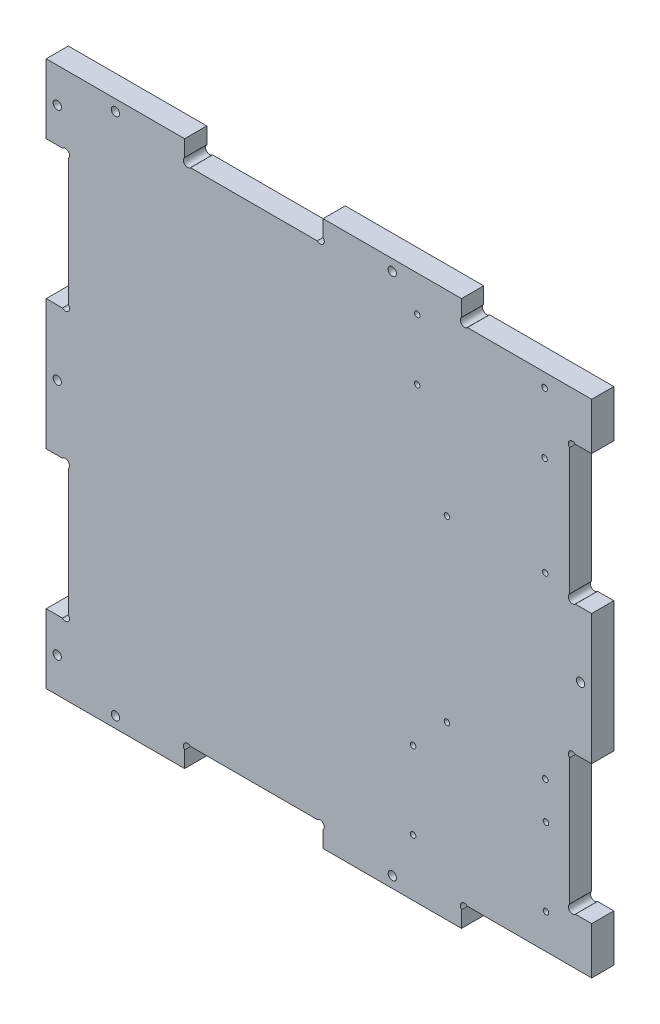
ISO-10303-21;
HEADER;
FILE_DESCRIPTION(('STEP AP214'),'2;1');
FILE_NAME('part.step','',(''),(''),'','','');
FILE_SCHEMA(('AUTOMOTIVE_DESIGN { 1 0 10303 214 1 1 1 1 }'));
ENDSEC;
DATA;
#1=APPLICATION_CONTEXT('core data for automotive mechanical design processes');
#2=APPLICATION_PROTOCOL_DEFINITION('international standard','automotive_design',2000,#1);
#3=PRODUCT_CONTEXT('',#1,'mechanical');
#4=PRODUCT('Part','Part','',(#3));
#5=PRODUCT_RELATED_PRODUCT_CATEGORY('part','',(#4));
#6=PRODUCT_DEFINITION_FORMATION('','',#4);
#7=PRODUCT_DEFINITION_CONTEXT('part definition',#1,'design');
#8=PRODUCT_DEFINITION('design','',#6,#7);
#9=PRODUCT_DEFINITION_SHAPE('','',#8);
#10=(LENGTH_UNIT() NAMED_UNIT(*) SI_UNIT(.MILLI.,.METRE.));
#11=(NAMED_UNIT(*) PLANE_ANGLE_UNIT() SI_UNIT($,.RADIAN.));
#12=(NAMED_UNIT(*) SI_UNIT($,.STERADIAN.) SOLID_ANGLE_UNIT());
#13=UNCERTAINTY_MEASURE_WITH_UNIT(LENGTH_MEASURE(1.E-05),#10,'distance_accuracy_value','');
#14=(GEOMETRIC_REPRESENTATION_CONTEXT(3) GLOBAL_UNCERTAINTY_ASSIGNED_CONTEXT((#13)) GLOBAL_UNIT_ASSIGNED_CONTEXT((#10,
#11,#12)) REPRESENTATION_CONTEXT('',''));
#15=CARTESIAN_POINT('',(0.,0.,0.));
#16=DIRECTION('',(0.,0.,1.));
#17=DIRECTION('',(1.,0.,0.));
#18=AXIS2_PLACEMENT_3D('',#15,#16,#17);
#19=CARTESIAN_POINT('',(113.264475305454,-162.098257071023,8.));
#20=DIRECTION('',(0.,0.,-1.));
#21=DIRECTION('',(-1.,0.,0.));
#22=AXIS2_PLACEMENT_3D('',#19,#20,#21);
#23=PLANE('',#22);
#24=CARTESIAN_POINT('',(94.7038151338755,-148.537596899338,8.));
#25=DIRECTION('',(0.,0.,1.));
#26=DIRECTION('',(1.,0.,0.));
#27=AXIS2_PLACEMENT_3D('',#24,#25,#26);
#28=CIRCLE('',#27,0.999999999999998);
#29=CARTESIAN_POINT('',(95.7038151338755,-148.537596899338,8.));
#30=VERTEX_POINT('',#29);
#31=EDGE_CURVE('E799',#30,#30,#28,.T.);
#32=ORIENTED_EDGE('',*,*,#31,.F.);
#33=EDGE_LOOP('',(#32));
#34=FACE_BOUND('',#33,.T.);
#35=CARTESIAN_POINT('',(142.703815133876,-120.537596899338,8.));
#36=DIRECTION('',(0.,0.,1.));
#37=DIRECTION('',(1.,0.,0.));
#38=AXIS2_PLACEMENT_3D('',#35,#36,#37);
#39=CIRCLE('',#38,0.999999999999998);
#40=CARTESIAN_POINT('',(143.703815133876,-120.537596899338,8.));
#41=VERTEX_POINT('',#40);
#42=EDGE_CURVE('E811',#41,#41,#39,.T.);
#43=ORIENTED_EDGE('',*,*,#42,.F.);
#44=EDGE_LOOP('',(#43));
#45=FACE_BOUND('',#44,.T.);
#46=CARTESIAN_POINT('',(142.45381513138,-107.18664155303,8.));
#47=DIRECTION('',(0.,0.,1.));
#48=DIRECTION('',(1.,0.,0.));
#49=AXIS2_PLACEMENT_3D('',#46,#47,#48);
#50=CIRCLE('',#49,0.999999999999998);
#51=CARTESIAN_POINT('',(143.45381513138,-107.18664155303,8.));
#52=VERTEX_POINT('',#51);
#53=EDGE_CURVE('E823',#52,#52,#50,.T.);
#54=ORIENTED_EDGE('',*,*,#53,.F.);
#55=EDGE_LOOP('',(#54));
#56=FACE_BOUND('',#55,.T.);
#57=CARTESIAN_POINT('',(142.453815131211,-42.6866415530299,8.));
#58=DIRECTION('',(0.,0.,1.));
#59=DIRECTION('',(1.,0.,0.));
#60=AXIS2_PLACEMENT_3D('',#57,#58,#59);
#61=CIRCLE('',#60,0.999999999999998);
#62=CARTESIAN_POINT('',(143.453815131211,-42.6866415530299,8.));
#63=VERTEX_POINT('',#62);
#64=EDGE_CURVE('E835',#63,#63,#61,.T.);
#65=ORIENTED_EDGE('',*,*,#64,.F.);
#66=EDGE_LOOP('',(#65));
#67=FACE_BOUND('',#66,.T.);
#68=CARTESIAN_POINT('',(96.203815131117,-6.93664155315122,8.));
#69=DIRECTION('',(0.,0.,1.));
#70=DIRECTION('',(1.,0.,0.));
#71=AXIS2_PLACEMENT_3D('',#68,#69,#70);
#72=CIRCLE('',#71,0.999999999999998);
#73=CARTESIAN_POINT('',(97.203815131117,-6.93664155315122,8.));
#74=VERTEX_POINT('',#73);
#75=EDGE_CURVE('E847',#74,#74,#72,.T.);
#76=ORIENTED_EDGE('',*,*,#75,.F.);
#77=EDGE_LOOP('',(#76));
#78=FACE_BOUND('',#77,.T.);
#79=CARTESIAN_POINT('',(-33.7961848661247,-156.537596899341,8.));
#80=DIRECTION('',(0.,0.,1.));
#81=DIRECTION('',(1.,0.,0.));
#82=AXIS2_PLACEMENT_3D('',#79,#80,#81);
#83=CIRCLE('',#82,1.5);
#84=CARTESIAN_POINT('',(-32.2961848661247,-156.537596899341,8.));
#85=VERTEX_POINT('',#84);
#86=EDGE_CURVE('E859',#85,#85,#83,.T.);
#87=ORIENTED_EDGE('',*,*,#86,.F.);
#88=EDGE_LOOP('',(#87));
#89=FACE_BOUND('',#88,.T.);
#90=CARTESIAN_POINT('',(87.2038151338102,-165.037596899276,8.));
#91=DIRECTION('',(0.,0.,1.));
#92=DIRECTION('',(1.,0.,0.));
#93=AXIS2_PLACEMENT_3D('',#90,#91,#92);
#94=CIRCLE('',#93,1.50000000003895);
#95=CARTESIAN_POINT('',(88.7038151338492,-165.037596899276,8.));
#96=VERTEX_POINT('',#95);
#97=EDGE_CURVE('E871',#96,#96,#94,.T.);
#98=ORIENTED_EDGE('',*,*,#97,.F.);
#99=EDGE_LOOP('',(#98));
#100=FACE_BOUND('',#99,.T.);
#101=CARTESIAN_POINT('',(87.2038151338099,23.9624031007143,8.));
#102=DIRECTION('',(0.,0.,1.));
#103=DIRECTION('',(-1.,0.,0.));
#104=AXIS2_PLACEMENT_3D('',#101,#102,#103);
#105=CIRCLE('',#104,1.50000000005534);
#106=CARTESIAN_POINT('',(85.7038151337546,23.9624031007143,8.));
#107=VERTEX_POINT('',#106);
#108=EDGE_CURVE('E883',#107,#107,#105,.T.);
#109=ORIENTED_EDGE('',*,*,#108,.F.);
#110=EDGE_LOOP('',(#109));
#111=FACE_BOUND('',#110,.T.);
#112=CARTESIAN_POINT('',(-33.7961848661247,15.4624031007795,8.));
#113=DIRECTION('',(0.,0.,1.));
#114=DIRECTION('',(-1.,0.,0.));
#115=AXIS2_PLACEMENT_3D('',#112,#113,#114);
#116=CIRCLE('',#115,1.49999999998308);
#117=CARTESIAN_POINT('',(-35.2961848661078,15.4624031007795,8.));
#118=VERTEX_POINT('',#117);
#119=EDGE_CURVE('E895',#118,#118,#116,.T.);
#120=ORIENTED_EDGE('',*,*,#119,.F.);
#121=EDGE_LOOP('',(#120));
#122=FACE_BOUND('',#121,.T.);
#123=CARTESIAN_POINT('',(-33.7961848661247,-70.5375968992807,8.));
#124=DIRECTION('',(0.,0.,1.));
#125=DIRECTION('',(1.,0.,0.));
#126=AXIS2_PLACEMENT_3D('',#123,#124,#125);
#127=CIRCLE('',#126,1.49999999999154);
#128=CARTESIAN_POINT('',(-32.2961848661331,-70.5375968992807,8.));
#129=VERTEX_POINT('',#128);
#130=EDGE_CURVE('E361',#129,#129,#127,.T.);
#131=ORIENTED_EDGE('',*,*,#130,.F.);
#132=EDGE_LOOP('',(#131));
#133=FACE_BOUND('',#132,.T.);
#134=DIRECTION('',(0.,1.,0.));
#135=VECTOR('',#134,1.);
#136=CARTESIAN_POINT('',(159.203815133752,-144.037596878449,8.));
#137=LINE('',#136,#135);
#138=CARTESIAN_POINT('',(159.203815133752,-161.037596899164,8.));
#139=VERTEX_POINT('',#138);
#140=CARTESIAN_POINT('',(159.203815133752,-144.037596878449,8.));
#141=VERTEX_POINT('',#140);
#142=EDGE_CURVE('E450',#139,#141,#137,.T.);
#143=ORIENTED_EDGE('',*,*,#142,.T.);
#144=DIRECTION('',(-1.,0.,0.));
#145=VECTOR('',#144,1.);
#146=CARTESIAN_POINT('',(153.325135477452,-144.037596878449,8.));
#147=LINE('',#146,#145);
#148=CARTESIAN_POINT('',(153.325135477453,-144.037596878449,8.));
#149=VERTEX_POINT('',#148);
#150=EDGE_CURVE('E206',#141,#149,#147,.T.);
#151=ORIENTED_EDGE('',*,*,#150,.T.);
#152=CARTESIAN_POINT('',(152.264475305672,-142.97693670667,8.));
#153=DIRECTION('',(0.,0.,-1.));
#154=DIRECTION('',(1.,0.,0.));
#155=AXIS2_PLACEMENT_3D('',#152,#153,#154);
#156=CIRCLE('',#155,1.49999999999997);
#157=CARTESIAN_POINT('',(151.203815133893,-141.916276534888,8.));
#158=VERTEX_POINT('',#157);
#159=EDGE_CURVE('E579',#149,#158,#156,.T.);
#160=ORIENTED_EDGE('',*,*,#159,.T.);
#161=DIRECTION('',(0.,1.,0.));
#162=VECTOR('',#161,1.);
#163=CARTESIAN_POINT('',(151.203815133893,-96.1589172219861,8.));
#164=LINE('',#163,#162);
#165=CARTESIAN_POINT('',(151.203815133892,-96.1589172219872,8.));
#166=VERTEX_POINT('',#165);
#167=EDGE_CURVE('E598',#158,#166,#164,.T.);
#168=ORIENTED_EDGE('',*,*,#167,.T.);
#169=CARTESIAN_POINT('',(152.26447530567,-95.0982570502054,8.));
#170=DIRECTION('',(0.,0.,-1.));
#171=DIRECTION('',(1.,0.,0.));
#172=AXIS2_PLACEMENT_3D('',#169,#170,#171);
#173=CIRCLE('',#172,1.50000000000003);
#174=CARTESIAN_POINT('',(153.325135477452,-94.0375968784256,8.));
#175=VERTEX_POINT('',#174);
#176=EDGE_CURVE('E595',#166,#175,#173,.T.);
#177=ORIENTED_EDGE('',*,*,#176,.T.);
#178=DIRECTION('',(1.,0.,0.));
#179=VECTOR('',#178,1.);
#180=CARTESIAN_POINT('',(159.203815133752,-94.0375968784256,8.));
#181=LINE('',#180,#179);
#182=CARTESIAN_POINT('',(159.203815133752,-94.0375968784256,8.));
#183=VERTEX_POINT('',#182);
#184=EDGE_CURVE('E597',#175,#183,#181,.T.);
#185=ORIENTED_EDGE('',*,*,#184,.T.);
#186=DIRECTION('',(0.,1.,0.));
#187=VECTOR('',#186,1.);
#188=CARTESIAN_POINT('',(159.203815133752,-47.0375968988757,8.));
#189=LINE('',#188,#187);
#190=CARTESIAN_POINT('',(159.203815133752,-47.0375968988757,8.));
#191=VERTEX_POINT('',#190);
#192=EDGE_CURVE('E600',#183,#191,#189,.T.);
#193=ORIENTED_EDGE('',*,*,#192,.T.);
#194=DIRECTION('',(-1.,0.,0.));
#195=VECTOR('',#194,1.);
#196=CARTESIAN_POINT('',(153.325135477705,-47.0375968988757,8.));
#197=LINE('',#196,#195);
#198=CARTESIAN_POINT('',(153.325135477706,-47.0375968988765,8.));
#199=VERTEX_POINT('',#198);
#200=EDGE_CURVE('E606',#191,#199,#197,.T.);
#201=ORIENTED_EDGE('',*,*,#200,.T.);
#202=CARTESIAN_POINT('',(152.264475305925,-45.9769367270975,8.));
#203=DIRECTION('',(0.,0.,-1.));
#204=DIRECTION('',(1.,0.,0.));
#205=AXIS2_PLACEMENT_3D('',#202,#203,#204);
#206=CIRCLE('',#205,1.50000000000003);
#207=CARTESIAN_POINT('',(151.203815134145,-44.916276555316,8.));
#208=VERTEX_POINT('',#207);
#209=EDGE_CURVE('E608',#199,#208,#206,.T.);
#210=ORIENTED_EDGE('',*,*,#209,.T.);
#211=DIRECTION('',(0.,1.,0.));
#212=VECTOR('',#211,1.);
#213=CARTESIAN_POINT('',(151.203815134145,0.841082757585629,8.));
#214=LINE('',#213,#212);
#215=CARTESIAN_POINT('',(151.203815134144,0.841082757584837,8.));
#216=VERTEX_POINT('',#215);
#217=EDGE_CURVE('E610',#208,#216,#214,.T.);
#218=ORIENTED_EDGE('',*,*,#217,.T.);
#219=CARTESIAN_POINT('',(152.264475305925,1.90174292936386,8.));
#220=DIRECTION('',(0.,0.,-1.));
#221=DIRECTION('',(1.,0.,0.));
#222=AXIS2_PLACEMENT_3D('',#219,#220,#221);
#223=CIRCLE('',#222,1.50000000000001);
#224=CARTESIAN_POINT('',(153.325135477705,2.96240310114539,8.));
#225=VERTEX_POINT('',#224);
#226=EDGE_CURVE('E612',#216,#225,#223,.T.);
#227=ORIENTED_EDGE('',*,*,#226,.T.);
#228=DIRECTION('',(1.,0.,0.));
#229=VECTOR('',#228,1.);
#230=CARTESIAN_POINT('',(159.203815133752,2.96240310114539,8.));
#231=LINE('',#230,#229);
#232=CARTESIAN_POINT('',(159.203815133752,2.96240310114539,8.));
#233=VERTEX_POINT('',#232);
#234=EDGE_CURVE('E614',#225,#233,#231,.T.);
#235=ORIENTED_EDGE('',*,*,#234,.T.);
#236=DIRECTION('',(0.,1.,0.));
#237=VECTOR('',#236,1.);
#238=CARTESIAN_POINT('',(159.203815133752,19.9624031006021,8.));
#239=LINE('',#238,#237);
#240=CARTESIAN_POINT('',(159.203815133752,19.9624031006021,8.));
#241=VERTEX_POINT('',#240);
#242=EDGE_CURVE('E616',#233,#241,#239,.T.);
#243=ORIENTED_EDGE('',*,*,#242,.T.);
#244=DIRECTION('',(-1.,0.,0.));
#245=VECTOR('',#244,1.);
#246=CARTESIAN_POINT('',(159.203815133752,19.9624031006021,8.));
#247=LINE('',#246,#245);
#248=CARTESIAN_POINT('',(114.325135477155,19.962403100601,8.));
#249=VERTEX_POINT('',#248);
#250=EDGE_CURVE('E618',#241,#249,#247,.T.);
#251=ORIENTED_EDGE('',*,*,#250,.T.);
#252=CARTESIAN_POINT('',(113.264475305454,21.0230632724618,8.));
#253=DIRECTION('',(0.,0.,-1.));
#254=DIRECTION('',(1.,0.,0.));
#255=AXIS2_PLACEMENT_3D('',#252,#253,#254);
#256=CIRCLE('',#255,1.50000000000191);
#257=CARTESIAN_POINT('',(112.203815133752,22.0837234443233,8.));
#258=VERTEX_POINT('',#257);
#259=EDGE_CURVE('E620',#249,#258,#256,.T.);
#260=ORIENTED_EDGE('',*,*,#259,.T.);
#261=DIRECTION('',(0.,1.,0.));
#262=VECTOR('',#261,1.);
#263=CARTESIAN_POINT('',(112.203815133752,22.0837234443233,8.));
#264=LINE('',#263,#262);
#265=CARTESIAN_POINT('',(112.203815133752,27.9624031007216,8.));
#266=VERTEX_POINT('',#265);
#267=EDGE_CURVE('E622',#258,#266,#264,.T.);
#268=ORIENTED_EDGE('',*,*,#267,.T.);
#269=DIRECTION('',(-1.,0.,0.));
#270=VECTOR('',#269,1.);
#271=CARTESIAN_POINT('',(62.2038151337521,27.9624031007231,8.));
#272=LINE('',#271,#270);
#273=CARTESIAN_POINT('',(62.2038151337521,27.9624031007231,8.));
#274=VERTEX_POINT('',#273);
#275=EDGE_CURVE('E624',#266,#274,#272,.T.);
#276=ORIENTED_EDGE('',*,*,#275,.T.);
#277=DIRECTION('',(0.,-1.,0.));
#278=VECTOR('',#277,1.);
#279=CARTESIAN_POINT('',(62.2038151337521,27.9624031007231,8.));
#280=LINE('',#279,#278);
#281=CARTESIAN_POINT('',(62.2038151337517,22.083723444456,8.));
#282=VERTEX_POINT('',#281);
#283=EDGE_CURVE('E626',#274,#282,#280,.T.);
#284=ORIENTED_EDGE('',*,*,#283,.T.);
#285=CARTESIAN_POINT('',(61.1431549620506,21.0230632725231,8.));
#286=DIRECTION('',(0.,0.,-1.));
#287=DIRECTION('',(1.,0.,0.));
#288=AXIS2_PLACEMENT_3D('',#285,#286,#287);
#289=CIRCLE('',#288,1.50000000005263);
#290=CARTESIAN_POINT('',(60.0824947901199,19.9624031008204,8.));
#291=VERTEX_POINT('',#290);
#292=EDGE_CURVE('E628',#282,#291,#289,.T.);
#293=ORIENTED_EDGE('',*,*,#292,.T.);
#294=DIRECTION('',(-1.,0.,0.));
#295=VECTOR('',#294,1.);
#296=CARTESIAN_POINT('',(60.0824947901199,19.9624031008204,8.));
#297=LINE('',#296,#295);
#298=CARTESIAN_POINT('',(14.325135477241,19.9624031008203,8.));
#299=VERTEX_POINT('',#298);
#300=EDGE_CURVE('E630',#291,#299,#297,.T.);
#301=ORIENTED_EDGE('',*,*,#300,.T.);
#302=CARTESIAN_POINT('',(13.2644753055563,21.0230632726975,8.));
#303=DIRECTION('',(0.,0.,-1.));
#304=DIRECTION('',(1.,0.,0.));
#305=AXIS2_PLACEMENT_3D('',#302,#303,#304);
#306=CIRCLE('',#305,1.50000000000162);
#307=CARTESIAN_POINT('',(12.2038151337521,22.0837234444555,8.));
#308=VERTEX_POINT('',#307);
#309=EDGE_CURVE('E632',#299,#308,#306,.T.);
#310=ORIENTED_EDGE('',*,*,#309,.T.);
#311=DIRECTION('',(0.,1.,0.));
#312=VECTOR('',#311,1.);
#313=CARTESIAN_POINT('',(12.2038151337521,22.0837234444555,8.));
#314=LINE('',#313,#312);
#315=CARTESIAN_POINT('',(12.2038151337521,27.9624031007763,8.));
#316=VERTEX_POINT('',#315);
#317=EDGE_CURVE('E634',#308,#316,#314,.T.);
#318=ORIENTED_EDGE('',*,*,#317,.T.);
#319=DIRECTION('',(-1.,0.,0.));
#320=VECTOR('',#319,1.);
#321=CARTESIAN_POINT('',(12.2038151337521,27.9624031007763,8.));
#322=LINE('',#321,#320);
#323=CARTESIAN_POINT('',(-37.7961848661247,27.9624031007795,8.));
#324=VERTEX_POINT('',#323);
#325=EDGE_CURVE('E636',#316,#324,#322,.T.);
#326=ORIENTED_EDGE('',*,*,#325,.T.);
#327=DIRECTION('',(-2.62262433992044E-12,-1.,0.));
#328=VECTOR('',#327,1.);
#329=CARTESIAN_POINT('',(-37.7961848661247,27.9624031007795,8.));
#330=LINE('',#329,#328);
#331=CARTESIAN_POINT('',(-37.7961848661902,2.96240310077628,8.));
#332=VERTEX_POINT('',#331);
#333=EDGE_CURVE('E638',#324,#332,#330,.T.);
#334=ORIENTED_EDGE('',*,*,#333,.T.);
#335=DIRECTION('',(1.,0.,0.));
#336=VECTOR('',#335,1.);
#337=CARTESIAN_POINT('',(-37.7961848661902,2.96240310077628,8.));
#338=LINE('',#337,#336);
#339=CARTESIAN_POINT('',(-31.9175052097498,2.96240310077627,8.));
#340=VERTEX_POINT('',#339);
#341=EDGE_CURVE('E640',#332,#340,#338,.T.);
#342=ORIENTED_EDGE('',*,*,#341,.T.);
#343=CARTESIAN_POINT('',(-30.8568450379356,1.90174292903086,8.));
#344=DIRECTION('',(0.,0.,-1.));
#345=DIRECTION('',(-1.,0.,0.));
#346=AXIS2_PLACEMENT_3D('',#343,#344,#345);
#347=CIRCLE('',#346,1.49999999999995);
#348=CARTESIAN_POINT('',(-29.7961848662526,0.84108275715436,8.));
#349=VERTEX_POINT('',#348);
#350=EDGE_CURVE('E642',#340,#349,#347,.T.);
#351=ORIENTED_EDGE('',*,*,#350,.T.);
#352=DIRECTION('',(0.,-1.,0.));
#353=VECTOR('',#352,1.);
#354=CARTESIAN_POINT('',(-29.7961848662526,-44.9162765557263,8.));
#355=LINE('',#354,#353);
#356=CARTESIAN_POINT('',(-29.7961848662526,-44.9162765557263,8.));
#357=VERTEX_POINT('',#356);
#358=EDGE_CURVE('E644',#349,#357,#355,.T.);
#359=ORIENTED_EDGE('',*,*,#358,.T.);
#360=CARTESIAN_POINT('',(-30.8568450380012,-45.976936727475,8.));
#361=DIRECTION('',(0.,0.,-1.));
#362=DIRECTION('',(-1.,0.,0.));
#363=AXIS2_PLACEMENT_3D('',#360,#361,#362);
#364=CIRCLE('',#363,1.49999999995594);
#365=CARTESIAN_POINT('',(-31.9175052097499,-47.0375968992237,8.));
#366=VERTEX_POINT('',#365);
#367=EDGE_CURVE('E646',#357,#366,#364,.T.);
#368=ORIENTED_EDGE('',*,*,#367,.T.);
#369=DIRECTION('',(-1.,0.,0.));
#370=VECTOR('',#369,1.);
#371=CARTESIAN_POINT('',(-31.9175052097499,-47.0375968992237,8.));
#372=LINE('',#371,#370);
#373=CARTESIAN_POINT('',(-37.7961848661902,-47.0375968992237,8.));
#374=VERTEX_POINT('',#373);
#375=EDGE_CURVE('E648',#366,#374,#372,.T.);
#376=ORIENTED_EDGE('',*,*,#375,.T.);
#377=DIRECTION('',(0.,-1.,0.));
#378=VECTOR('',#377,1.);
#379=CARTESIAN_POINT('',(-37.7961848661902,-47.0375968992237,8.));
#380=LINE('',#379,#378);
#381=CARTESIAN_POINT('',(-37.7961848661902,-94.0375968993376,8.));
#382=VERTEX_POINT('',#381);
#383=EDGE_CURVE('E650',#374,#382,#380,.T.);
#384=ORIENTED_EDGE('',*,*,#383,.T.);
#385=DIRECTION('',(1.,0.,0.));
#386=VECTOR('',#385,1.);
#387=CARTESIAN_POINT('',(-31.9175052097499,-94.0375968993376,8.));
#388=LINE('',#387,#386);
#389=CARTESIAN_POINT('',(-31.9175052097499,-94.0375968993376,8.));
#390=VERTEX_POINT('',#389);
#391=EDGE_CURVE('E652',#382,#390,#388,.T.);
#392=ORIENTED_EDGE('',*,*,#391,.T.);
#393=CARTESIAN_POINT('',(-30.8568450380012,-95.0982570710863,8.));
#394=DIRECTION('',(0.,0.,-1.));
#395=DIRECTION('',(1.,0.,0.));
#396=AXIS2_PLACEMENT_3D('',#393,#394,#395);
#397=CIRCLE('',#396,1.49999999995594);
#398=CARTESIAN_POINT('',(-29.7961848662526,-96.158917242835,8.));
#399=VERTEX_POINT('',#398);
#400=EDGE_CURVE('E654',#390,#399,#397,.T.);
#401=ORIENTED_EDGE('',*,*,#400,.T.);
#402=DIRECTION('',(0.,-1.,0.));
#403=VECTOR('',#402,1.);
#404=CARTESIAN_POINT('',(-29.7961848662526,-96.158917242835,8.));
#405=LINE('',#404,#403);
#406=CARTESIAN_POINT('',(-29.7961848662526,-141.916276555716,8.));
#407=VERTEX_POINT('',#406);
#408=EDGE_CURVE('E656',#399,#407,#405,.T.);
#409=ORIENTED_EDGE('',*,*,#408,.T.);
#410=CARTESIAN_POINT('',(-30.8568450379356,-142.976936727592,8.));
#411=DIRECTION('',(0.,0.,-1.));
#412=DIRECTION('',(1.,0.,0.));
#413=AXIS2_PLACEMENT_3D('',#410,#411,#412);
#414=CIRCLE('',#413,1.49999999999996);
#415=CARTESIAN_POINT('',(-31.9175052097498,-144.037596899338,8.));
#416=VERTEX_POINT('',#415);
#417=EDGE_CURVE('E658',#407,#416,#414,.T.);
#418=ORIENTED_EDGE('',*,*,#417,.T.);
#419=DIRECTION('',(-1.,0.,0.));
#420=VECTOR('',#419,1.);
#421=CARTESIAN_POINT('',(-37.7961848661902,-144.037596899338,8.));
#422=LINE('',#421,#420);
#423=CARTESIAN_POINT('',(-37.7961848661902,-144.037596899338,8.));
#424=VERTEX_POINT('',#423);
#425=EDGE_CURVE('E660',#416,#424,#422,.T.);
#426=ORIENTED_EDGE('',*,*,#425,.T.);
#427=DIRECTION('',(2.62262433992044E-12,-1.,0.));
#428=VECTOR('',#427,1.);
#429=CARTESIAN_POINT('',(-37.7961848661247,-169.037596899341,8.));
#430=LINE('',#429,#428);
#431=CARTESIAN_POINT('',(-37.7961848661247,-169.037596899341,8.));
#432=VERTEX_POINT('',#431);
#433=EDGE_CURVE('E662',#424,#432,#430,.T.);
#434=ORIENTED_EDGE('',*,*,#433,.T.);
#435=DIRECTION('',(1.,3.98986399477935E-13,0.));
#436=VECTOR('',#435,1.);
#437=CARTESIAN_POINT('',(-29.7961848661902,-169.037596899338,8.));
#438=LINE('',#437,#436);
#439=CARTESIAN_POINT('',(12.2038151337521,-169.037596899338,8.));
#440=VERTEX_POINT('',#439);
#441=EDGE_CURVE('E664',#432,#440,#438,.T.);
#442=ORIENTED_EDGE('',*,*,#441,.T.);
#443=DIRECTION('',(0.,1.,0.));
#444=VECTOR('',#443,1.);
#445=CARTESIAN_POINT('',(12.2038151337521,-163.158917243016,8.));
#446=LINE('',#445,#444);
#447=CARTESIAN_POINT('',(12.2038151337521,-163.158917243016,8.));
#448=VERTEX_POINT('',#447);
#449=EDGE_CURVE('E666',#440,#448,#446,.T.);
#450=ORIENTED_EDGE('',*,*,#449,.T.);
#451=CARTESIAN_POINT('',(13.2644753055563,-162.098257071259,8.));
#452=DIRECTION('',(0.,0.,-1.));
#453=DIRECTION('',(-1.,0.,0.));
#454=AXIS2_PLACEMENT_3D('',#451,#452,#453);
#455=CIRCLE('',#454,1.50000000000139);
#456=CARTESIAN_POINT('',(14.3251354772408,-161.037596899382,8.));
#457=VERTEX_POINT('',#456);
#458=EDGE_CURVE('E668',#448,#457,#455,.T.);
#459=ORIENTED_EDGE('',*,*,#458,.T.);
#460=DIRECTION('',(1.,0.,0.));
#461=VECTOR('',#460,1.);
#462=CARTESIAN_POINT('',(60.0824947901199,-161.037596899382,8.));
#463=LINE('',#462,#461);
#464=CARTESIAN_POINT('',(60.0824947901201,-161.037596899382,8.));
#465=VERTEX_POINT('',#464);
#466=EDGE_CURVE('E670',#457,#465,#463,.T.);
#467=ORIENTED_EDGE('',*,*,#466,.T.);
#468=CARTESIAN_POINT('',(61.1431549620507,-162.098257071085,8.));
#469=DIRECTION('',(0.,0.,-1.));
#470=DIRECTION('',(-1.,0.,0.));
#471=AXIS2_PLACEMENT_3D('',#468,#469,#470);
#472=CIRCLE('',#471,1.50000000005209);
#473=CARTESIAN_POINT('',(62.2038151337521,-163.158917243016,8.));
#474=VERTEX_POINT('',#473);
#475=EDGE_CURVE('E672',#465,#474,#472,.T.);
#476=ORIENTED_EDGE('',*,*,#475,.T.);
#477=DIRECTION('',(0.,-1.,0.));
#478=VECTOR('',#477,1.);
#479=CARTESIAN_POINT('',(62.2038151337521,-169.037596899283,8.));
#480=LINE('',#479,#478);
#481=CARTESIAN_POINT('',(62.2038151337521,-169.037596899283,8.));
#482=VERTEX_POINT('',#481);
#483=EDGE_CURVE('E674',#474,#482,#480,.T.);
#484=ORIENTED_EDGE('',*,*,#483,.T.);
#485=DIRECTION('',(1.,0.,0.));
#486=VECTOR('',#485,1.);
#487=CARTESIAN_POINT('',(62.2038151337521,-169.037596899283,8.));
#488=LINE('',#487,#486);
#489=CARTESIAN_POINT('',(112.203815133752,-169.037596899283,8.));
#490=VERTEX_POINT('',#489);
#491=EDGE_CURVE('E339',#482,#490,#488,.T.);
#492=ORIENTED_EDGE('',*,*,#491,.T.);
#493=DIRECTION('',(0.,1.,0.));
#494=VECTOR('',#493,1.);
#495=CARTESIAN_POINT('',(112.203815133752,-163.158917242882,8.));
#496=LINE('',#495,#494);
#497=CARTESIAN_POINT('',(112.203815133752,-163.158917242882,8.));
#498=VERTEX_POINT('',#497);
#499=EDGE_CURVE('E333',#490,#498,#496,.T.);
#500=ORIENTED_EDGE('',*,*,#499,.T.);
#501=CARTESIAN_POINT('',(113.264475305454,-162.098257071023,8.));
#502=DIRECTION('',(0.,0.,-1.));
#503=DIRECTION('',(-1.,0.,0.));
#504=AXIS2_PLACEMENT_3D('',#501,#502,#503);
#505=CIRCLE('',#504,1.50000000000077);
#506=CARTESIAN_POINT('',(114.325135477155,-161.037596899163,8.));
#507=VERTEX_POINT('',#506);
#508=EDGE_CURVE('E337',#498,#507,#505,.T.);
#509=ORIENTED_EDGE('',*,*,#508,.T.);
#510=DIRECTION('',(1.,0.,0.));
#511=VECTOR('',#510,1.);
#512=CARTESIAN_POINT('',(159.203815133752,-161.037596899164,8.));
#513=LINE('',#512,#511);
#514=EDGE_CURVE('E49',#507,#139,#513,.T.);
#515=ORIENTED_EDGE('',*,*,#514,.T.);
#516=EDGE_LOOP('',(#143,#151,#160,#168,#177,#185,#193,#201,#210,#218,#227,#235,#243,#251,#260,
#268,#276,#284,#293,#301,#310,#318,#326,#334,#342,#351,#359,#368,#376,#384,#392,#401,#409,#418,
#426,#434,#442,#450,#459,#467,#476,#484,#492,#500,#509,#515));
#517=FACE_BOUND('',#516,.T.);
#518=CARTESIAN_POINT('',(155.203815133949,-70.5375968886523,8.));
#519=DIRECTION('',(0.,0.,1.));
#520=DIRECTION('',(1.,0.,0.));
#521=AXIS2_PLACEMENT_3D('',#518,#519,#520);
#522=CIRCLE('',#521,1.49999999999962);
#523=CARTESIAN_POINT('',(156.703815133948,-70.5375968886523,8.));
#524=VERTEX_POINT('',#523);
#525=EDGE_CURVE('E901',#524,#524,#522,.T.);
#526=ORIENTED_EDGE('',*,*,#525,.F.);
#527=EDGE_LOOP('',(#526));
#528=FACE_BOUND('',#527,.T.);
#529=CARTESIAN_POINT('',(-12.7961848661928,23.9624031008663,8.));
#530=DIRECTION('',(0.,0.,1.));
#531=DIRECTION('',(-1.,0.,0.));
#532=AXIS2_PLACEMENT_3D('',#529,#530,#531);
#533=CIRCLE('',#532,1.49999999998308);
#534=CARTESIAN_POINT('',(-14.2961848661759,23.9624031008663,8.));
#535=VERTEX_POINT('',#534);
#536=EDGE_CURVE('E889',#535,#535,#533,.T.);
#537=ORIENTED_EDGE('',*,*,#536,.F.);
#538=EDGE_LOOP('',(#537));
#539=FACE_BOUND('',#538,.T.);
#540=CARTESIAN_POINT('',(142.203815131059,15.0633584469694,8.));
#541=DIRECTION('',(0.,0.,1.));
#542=DIRECTION('',(1.,0.,0.));
#543=AXIS2_PLACEMENT_3D('',#540,#541,#542);
#544=CIRCLE('',#543,0.999999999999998);
#545=CARTESIAN_POINT('',(143.203815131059,15.0633584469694,8.));
#546=VERTEX_POINT('',#545);
#547=EDGE_CURVE('E877',#546,#546,#544,.T.);
#548=ORIENTED_EDGE('',*,*,#547,.F.);
#549=EDGE_LOOP('',(#548));
#550=FACE_BOUND('',#549,.T.);
#551=CARTESIAN_POINT('',(-12.7961848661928,-165.037596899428,8.));
#552=DIRECTION('',(0.,0.,1.));
#553=DIRECTION('',(1.,0.,0.));
#554=AXIS2_PLACEMENT_3D('',#551,#552,#553);
#555=CIRCLE('',#554,1.5);
#556=CARTESIAN_POINT('',(-11.2961848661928,-165.037596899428,8.));
#557=VERTEX_POINT('',#556);
#558=EDGE_CURVE('E865',#557,#557,#555,.T.);
#559=ORIENTED_EDGE('',*,*,#558,.F.);
#560=EDGE_LOOP('',(#559));
#561=FACE_BOUND('',#560,.T.);
#562=CARTESIAN_POINT('',(142.203815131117,-6.93664155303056,8.));
#563=DIRECTION('',(0.,0.,1.));
#564=DIRECTION('',(1.,0.,0.));
#565=AXIS2_PLACEMENT_3D('',#562,#563,#564);
#566=CIRCLE('',#565,0.999999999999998);
#567=CARTESIAN_POINT('',(143.203815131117,-6.93664155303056,8.));
#568=VERTEX_POINT('',#567);
#569=EDGE_CURVE('E853',#568,#568,#566,.T.);
#570=ORIENTED_EDGE('',*,*,#569,.F.);
#571=EDGE_LOOP('',(#570));
#572=FACE_BOUND('',#571,.T.);
#573=CARTESIAN_POINT('',(96.2038151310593,15.0633584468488,8.));
#574=DIRECTION('',(0.,0.,1.));
#575=DIRECTION('',(1.,0.,0.));
#576=AXIS2_PLACEMENT_3D('',#573,#574,#575);
#577=CIRCLE('',#576,0.999999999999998);
#578=CARTESIAN_POINT('',(97.2038151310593,15.0633584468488,8.));
#579=VERTEX_POINT('',#578);
#580=EDGE_CURVE('E841',#579,#579,#577,.T.);
#581=ORIENTED_EDGE('',*,*,#580,.F.);
#582=EDGE_LOOP('',(#581));
#583=FACE_BOUND('',#582,.T.);
#584=CARTESIAN_POINT('',(106.953815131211,-42.686641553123,8.));
#585=DIRECTION('',(0.,0.,1.));
#586=DIRECTION('',(1.,0.,0.));
#587=AXIS2_PLACEMENT_3D('',#584,#585,#586);
#588=CIRCLE('',#587,0.999999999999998);
#589=CARTESIAN_POINT('',(107.953815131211,-42.686641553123,8.));
#590=VERTEX_POINT('',#589);
#591=EDGE_CURVE('E829',#590,#590,#588,.T.);
#592=ORIENTED_EDGE('',*,*,#591,.F.);
#593=EDGE_LOOP('',(#592));
#594=FACE_BOUND('',#593,.T.);
#595=CARTESIAN_POINT('',(106.95381513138,-107.186641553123,8.));
#596=DIRECTION('',(0.,0.,1.));
#597=DIRECTION('',(1.,0.,0.));
#598=AXIS2_PLACEMENT_3D('',#595,#596,#597);
#599=CIRCLE('',#598,0.999999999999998);
#600=CARTESIAN_POINT('',(107.95381513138,-107.186641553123,8.));
#601=VERTEX_POINT('',#600);
#602=EDGE_CURVE('E817',#601,#601,#599,.T.);
#603=ORIENTED_EDGE('',*,*,#602,.F.);
#604=EDGE_LOOP('',(#603));
#605=FACE_BOUND('',#604,.T.);
#606=CARTESIAN_POINT('',(94.7038151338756,-120.537596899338,8.));
#607=DIRECTION('',(0.,0.,1.));
#608=DIRECTION('',(1.,0.,0.));
#609=AXIS2_PLACEMENT_3D('',#606,#607,#608);
#610=CIRCLE('',#609,0.999999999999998);
#611=CARTESIAN_POINT('',(95.7038151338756,-120.537596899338,8.));
#612=VERTEX_POINT('',#611);
#613=EDGE_CURVE('E805',#612,#612,#610,.T.);
#614=ORIENTED_EDGE('',*,*,#613,.F.);
#615=EDGE_LOOP('',(#614));
#616=FACE_BOUND('',#615,.T.);
#617=CARTESIAN_POINT('',(142.703815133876,-148.537596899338,8.));
#618=DIRECTION('',(0.,0.,1.));
#619=DIRECTION('',(1.,0.,0.));
#620=AXIS2_PLACEMENT_3D('',#617,#618,#619);
#621=CIRCLE('',#620,0.999999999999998);
#622=CARTESIAN_POINT('',(143.703815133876,-148.537596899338,8.));
#623=VERTEX_POINT('',#622);
#624=EDGE_CURVE('E790',#623,#623,#621,.T.);
#625=ORIENTED_EDGE('',*,*,#624,.F.);
#626=EDGE_LOOP('',(#625));
#627=FACE_BOUND('',#626,.T.);
#628=ADVANCED_FACE('F32',(#34,#45,#56,#67,#78,#89,#100,#111,#122,#133,#517,#528,#539,#550,#561,
#572,#583,#594,#605,#616,#627),#23,.F.);
#629=CARTESIAN_POINT('',(113.264475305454,-162.098257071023,0.));
#630=DIRECTION('',(0.,0.,-1.));
#631=DIRECTION('',(-1.,0.,0.));
#632=AXIS2_PLACEMENT_3D('',#629,#630,#631);
#633=PLANE('',#632);
#634=CARTESIAN_POINT('',(94.7038151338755,-148.537596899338,0.));
#635=DIRECTION('',(0.,0.,1.));
#636=DIRECTION('',(1.,0.,0.));
#637=AXIS2_PLACEMENT_3D('',#634,#635,#636);
#638=CIRCLE('',#637,0.999999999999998);
#639=CARTESIAN_POINT('',(95.7038151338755,-148.537596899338,0.));
#640=VERTEX_POINT('',#639);
#641=EDGE_CURVE('E796',#640,#640,#638,.T.);
#642=ORIENTED_EDGE('',*,*,#641,.T.);
#643=EDGE_LOOP('',(#642));
#644=FACE_BOUND('',#643,.T.);
#645=CARTESIAN_POINT('',(142.703815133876,-120.537596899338,0.));
#646=DIRECTION('',(0.,0.,1.));
#647=DIRECTION('',(1.,0.,0.));
#648=AXIS2_PLACEMENT_3D('',#645,#646,#647);
#649=CIRCLE('',#648,0.999999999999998);
#650=CARTESIAN_POINT('',(143.703815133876,-120.537596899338,0.));
#651=VERTEX_POINT('',#650);
#652=EDGE_CURVE('E808',#651,#651,#649,.T.);
#653=ORIENTED_EDGE('',*,*,#652,.T.);
#654=EDGE_LOOP('',(#653));
#655=FACE_BOUND('',#654,.T.);
#656=CARTESIAN_POINT('',(142.45381513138,-107.18664155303,0.));
#657=DIRECTION('',(0.,0.,1.));
#658=DIRECTION('',(1.,0.,0.));
#659=AXIS2_PLACEMENT_3D('',#656,#657,#658);
#660=CIRCLE('',#659,0.999999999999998);
#661=CARTESIAN_POINT('',(143.45381513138,-107.18664155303,0.));
#662=VERTEX_POINT('',#661);
#663=EDGE_CURVE('E820',#662,#662,#660,.T.);
#664=ORIENTED_EDGE('',*,*,#663,.T.);
#665=EDGE_LOOP('',(#664));
#666=FACE_BOUND('',#665,.T.);
#667=CARTESIAN_POINT('',(142.453815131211,-42.6866415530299,0.));
#668=DIRECTION('',(0.,0.,1.));
#669=DIRECTION('',(1.,0.,0.));
#670=AXIS2_PLACEMENT_3D('',#667,#668,#669);
#671=CIRCLE('',#670,0.999999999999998);
#672=CARTESIAN_POINT('',(143.453815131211,-42.6866415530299,0.));
#673=VERTEX_POINT('',#672);
#674=EDGE_CURVE('E832',#673,#673,#671,.T.);
#675=ORIENTED_EDGE('',*,*,#674,.T.);
#676=EDGE_LOOP('',(#675));
#677=FACE_BOUND('',#676,.T.);
#678=CARTESIAN_POINT('',(96.203815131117,-6.93664155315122,0.));
#679=DIRECTION('',(0.,0.,1.));
#680=DIRECTION('',(1.,0.,0.));
#681=AXIS2_PLACEMENT_3D('',#678,#679,#680);
#682=CIRCLE('',#681,0.999999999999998);
#683=CARTESIAN_POINT('',(97.203815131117,-6.93664155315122,0.));
#684=VERTEX_POINT('',#683);
#685=EDGE_CURVE('E844',#684,#684,#682,.T.);
#686=ORIENTED_EDGE('',*,*,#685,.T.);
#687=EDGE_LOOP('',(#686));
#688=FACE_BOUND('',#687,.T.);
#689=CARTESIAN_POINT('',(-33.7961848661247,-156.537596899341,0.));
#690=DIRECTION('',(0.,0.,1.));
#691=DIRECTION('',(1.,0.,0.));
#692=AXIS2_PLACEMENT_3D('',#689,#690,#691);
#693=CIRCLE('',#692,1.5);
#694=CARTESIAN_POINT('',(-32.2961848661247,-156.537596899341,0.));
#695=VERTEX_POINT('',#694);
#696=EDGE_CURVE('E856',#695,#695,#693,.T.);
#697=ORIENTED_EDGE('',*,*,#696,.T.);
#698=EDGE_LOOP('',(#697));
#699=FACE_BOUND('',#698,.T.);
#700=CARTESIAN_POINT('',(87.2038151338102,-165.037596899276,0.));
#701=DIRECTION('',(0.,0.,1.));
#702=DIRECTION('',(1.,0.,0.));
#703=AXIS2_PLACEMENT_3D('',#700,#701,#702);
#704=CIRCLE('',#703,1.50000000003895);
#705=CARTESIAN_POINT('',(88.7038151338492,-165.037596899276,0.));
#706=VERTEX_POINT('',#705);
#707=EDGE_CURVE('E868',#706,#706,#704,.T.);
#708=ORIENTED_EDGE('',*,*,#707,.T.);
#709=EDGE_LOOP('',(#708));
#710=FACE_BOUND('',#709,.T.);
#711=CARTESIAN_POINT('',(87.2038151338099,23.9624031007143,0.));
#712=DIRECTION('',(0.,0.,1.));
#713=DIRECTION('',(-1.,0.,0.));
#714=AXIS2_PLACEMENT_3D('',#711,#712,#713);
#715=CIRCLE('',#714,1.50000000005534);
#716=CARTESIAN_POINT('',(85.7038151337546,23.9624031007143,0.));
#717=VERTEX_POINT('',#716);
#718=EDGE_CURVE('E880',#717,#717,#715,.T.);
#719=ORIENTED_EDGE('',*,*,#718,.T.);
#720=EDGE_LOOP('',(#719));
#721=FACE_BOUND('',#720,.T.);
#722=CARTESIAN_POINT('',(-33.7961848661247,15.4624031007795,0.));
#723=DIRECTION('',(0.,0.,1.));
#724=DIRECTION('',(-1.,0.,0.));
#725=AXIS2_PLACEMENT_3D('',#722,#723,#724);
#726=CIRCLE('',#725,1.49999999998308);
#727=CARTESIAN_POINT('',(-35.2961848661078,15.4624031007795,0.));
#728=VERTEX_POINT('',#727);
#729=EDGE_CURVE('E892',#728,#728,#726,.T.);
#730=ORIENTED_EDGE('',*,*,#729,.T.);
#731=EDGE_LOOP('',(#730));
#732=FACE_BOUND('',#731,.T.);
#733=CARTESIAN_POINT('',(-33.7961848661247,-70.5375968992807,0.));
#734=DIRECTION('',(0.,0.,1.));
#735=DIRECTION('',(1.,0.,0.));
#736=AXIS2_PLACEMENT_3D('',#733,#734,#735);
#737=CIRCLE('',#736,1.49999999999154);
#738=CARTESIAN_POINT('',(-32.2961848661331,-70.5375968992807,0.));
#739=VERTEX_POINT('',#738);
#740=EDGE_CURVE('E904',#739,#739,#737,.T.);
#741=ORIENTED_EDGE('',*,*,#740,.T.);
#742=EDGE_LOOP('',(#741));
#743=FACE_BOUND('',#742,.T.);
#744=DIRECTION('',(0.,1.,0.));
#745=VECTOR('',#744,1.);
#746=CARTESIAN_POINT('',(159.203815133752,-144.037596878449,0.));
#747=LINE('',#746,#745);
#748=CARTESIAN_POINT('',(159.203815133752,-161.037596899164,0.));
#749=VERTEX_POINT('',#748);
#750=CARTESIAN_POINT('',(159.203815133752,-144.037596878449,0.));
#751=VERTEX_POINT('',#750);
#752=EDGE_CURVE('E357',#749,#751,#747,.T.);
#753=ORIENTED_EDGE('',*,*,#752,.F.);
#754=DIRECTION('',(1.,0.,0.));
#755=VECTOR('',#754,1.);
#756=CARTESIAN_POINT('',(159.203815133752,-161.037596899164,0.));
#757=LINE('',#756,#755);
#758=CARTESIAN_POINT('',(114.325135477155,-161.037596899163,0.));
#759=VERTEX_POINT('',#758);
#760=EDGE_CURVE('E198',#759,#749,#757,.T.);
#761=ORIENTED_EDGE('',*,*,#760,.F.);
#762=CARTESIAN_POINT('',(113.264475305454,-162.098257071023,0.));
#763=DIRECTION('',(0.,0.,-1.));
#764=DIRECTION('',(-1.,0.,0.));
#765=AXIS2_PLACEMENT_3D('',#762,#763,#764);
#766=CIRCLE('',#765,1.50000000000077);
#767=CARTESIAN_POINT('',(112.203815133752,-163.158917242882,0.));
#768=VERTEX_POINT('',#767);
#769=EDGE_CURVE('E192',#768,#759,#766,.T.);
#770=ORIENTED_EDGE('',*,*,#769,.F.);
#771=DIRECTION('',(0.,1.,0.));
#772=VECTOR('',#771,1.);
#773=CARTESIAN_POINT('',(112.203815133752,-163.158917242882,0.));
#774=LINE('',#773,#772);
#775=CARTESIAN_POINT('',(112.203815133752,-169.037596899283,0.));
#776=VERTEX_POINT('',#775);
#777=EDGE_CURVE('E347',#776,#768,#774,.T.);
#778=ORIENTED_EDGE('',*,*,#777,.F.);
#779=DIRECTION('',(1.,0.,0.));
#780=VECTOR('',#779,1.);
#781=CARTESIAN_POINT('',(62.2038151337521,-169.037596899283,0.));
#782=LINE('',#781,#780);
#783=CARTESIAN_POINT('',(62.2038151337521,-169.037596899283,0.));
#784=VERTEX_POINT('',#783);
#785=EDGE_CURVE('E445',#784,#776,#782,.T.);
#786=ORIENTED_EDGE('',*,*,#785,.F.);
#787=DIRECTION('',(0.,-1.,0.));
#788=VECTOR('',#787,1.);
#789=CARTESIAN_POINT('',(62.2038151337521,-169.037596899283,0.));
#790=LINE('',#789,#788);
#791=CARTESIAN_POINT('',(62.2038151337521,-163.158917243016,0.));
#792=VERTEX_POINT('',#791);
#793=EDGE_CURVE('E443',#792,#784,#790,.T.);
#794=ORIENTED_EDGE('',*,*,#793,.F.);
#795=CARTESIAN_POINT('',(61.1431549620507,-162.098257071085,0.));
#796=DIRECTION('',(0.,0.,-1.));
#797=DIRECTION('',(-1.,0.,0.));
#798=AXIS2_PLACEMENT_3D('',#795,#796,#797);
#799=CIRCLE('',#798,1.50000000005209);
#800=CARTESIAN_POINT('',(60.0824947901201,-161.037596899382,0.));
#801=VERTEX_POINT('',#800);
#802=EDGE_CURVE('E441',#801,#792,#799,.T.);
#803=ORIENTED_EDGE('',*,*,#802,.F.);
#804=DIRECTION('',(1.,0.,0.));
#805=VECTOR('',#804,1.);
#806=CARTESIAN_POINT('',(60.0824947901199,-161.037596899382,0.));
#807=LINE('',#806,#805);
#808=CARTESIAN_POINT('',(14.3251354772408,-161.037596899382,0.));
#809=VERTEX_POINT('',#808);
#810=EDGE_CURVE('E439',#809,#801,#807,.T.);
#811=ORIENTED_EDGE('',*,*,#810,.F.);
#812=CARTESIAN_POINT('',(13.2644753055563,-162.098257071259,0.));
#813=DIRECTION('',(0.,0.,-1.));
#814=DIRECTION('',(-1.,0.,0.));
#815=AXIS2_PLACEMENT_3D('',#812,#813,#814);
#816=CIRCLE('',#815,1.50000000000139);
#817=CARTESIAN_POINT('',(12.2038151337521,-163.158917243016,0.));
#818=VERTEX_POINT('',#817);
#819=EDGE_CURVE('E437',#818,#809,#816,.T.);
#820=ORIENTED_EDGE('',*,*,#819,.F.);
#821=DIRECTION('',(0.,1.,0.));
#822=VECTOR('',#821,1.);
#823=CARTESIAN_POINT('',(12.2038151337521,-163.158917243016,0.));
#824=LINE('',#823,#822);
#825=CARTESIAN_POINT('',(12.2038151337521,-169.037596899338,0.));
#826=VERTEX_POINT('',#825);
#827=EDGE_CURVE('E435',#826,#818,#824,.T.);
#828=ORIENTED_EDGE('',*,*,#827,.F.);
#829=DIRECTION('',(1.,0.,0.));
#830=VECTOR('',#829,1.);
#831=CARTESIAN_POINT('',(12.2038151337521,-169.037596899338,0.));
#832=LINE('',#831,#830);
#833=CARTESIAN_POINT('',(-37.7961848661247,-169.037596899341,0.));
#834=VERTEX_POINT('',#833);
#835=EDGE_CURVE('E433',#834,#826,#832,.T.);
#836=ORIENTED_EDGE('',*,*,#835,.F.);
#837=DIRECTION('',(2.62262433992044E-12,-1.,0.));
#838=VECTOR('',#837,1.);
#839=CARTESIAN_POINT('',(-37.7961848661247,-169.037596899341,0.));
#840=LINE('',#839,#838);
#841=CARTESIAN_POINT('',(-37.7961848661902,-144.037596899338,0.));
#842=VERTEX_POINT('',#841);
#843=EDGE_CURVE('E430',#842,#834,#840,.T.);
#844=ORIENTED_EDGE('',*,*,#843,.F.);
#845=DIRECTION('',(-1.,0.,0.));
#846=VECTOR('',#845,1.);
#847=CARTESIAN_POINT('',(-37.7961848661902,-144.037596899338,0.));
#848=LINE('',#847,#846);
#849=CARTESIAN_POINT('',(-31.9175052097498,-144.037596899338,0.));
#850=VERTEX_POINT('',#849);
#851=EDGE_CURVE('E428',#850,#842,#848,.T.);
#852=ORIENTED_EDGE('',*,*,#851,.F.);
#853=CARTESIAN_POINT('',(-30.8568450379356,-142.976936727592,0.));
#854=DIRECTION('',(0.,0.,-1.));
#855=DIRECTION('',(1.,0.,0.));
#856=AXIS2_PLACEMENT_3D('',#853,#854,#855);
#857=CIRCLE('',#856,1.49999999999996);
#858=CARTESIAN_POINT('',(-29.7961848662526,-141.916276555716,0.));
#859=VERTEX_POINT('',#858);
#860=EDGE_CURVE('E426',#859,#850,#857,.T.);
#861=ORIENTED_EDGE('',*,*,#860,.F.);
#862=DIRECTION('',(0.,-1.,0.));
#863=VECTOR('',#862,1.);
#864=CARTESIAN_POINT('',(-29.7961848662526,-96.158917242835,0.));
#865=LINE('',#864,#863);
#866=CARTESIAN_POINT('',(-29.7961848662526,-96.158917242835,0.));
#867=VERTEX_POINT('',#866);
#868=EDGE_CURVE('E424',#867,#859,#865,.T.);
#869=ORIENTED_EDGE('',*,*,#868,.F.);
#870=CARTESIAN_POINT('',(-30.8568450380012,-95.0982570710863,0.));
#871=DIRECTION('',(0.,0.,-1.));
#872=DIRECTION('',(1.,0.,0.));
#873=AXIS2_PLACEMENT_3D('',#870,#871,#872);
#874=CIRCLE('',#873,1.49999999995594);
#875=CARTESIAN_POINT('',(-31.9175052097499,-94.0375968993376,0.));
#876=VERTEX_POINT('',#875);
#877=EDGE_CURVE('E422',#876,#867,#874,.T.);
#878=ORIENTED_EDGE('',*,*,#877,.F.);
#879=DIRECTION('',(1.,0.,0.));
#880=VECTOR('',#879,1.);
#881=CARTESIAN_POINT('',(-31.9175052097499,-94.0375968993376,0.));
#882=LINE('',#881,#880);
#883=CARTESIAN_POINT('',(-37.7961848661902,-94.0375968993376,0.));
#884=VERTEX_POINT('',#883);
#885=EDGE_CURVE('E420',#884,#876,#882,.T.);
#886=ORIENTED_EDGE('',*,*,#885,.F.);
#887=DIRECTION('',(0.,-1.,0.));
#888=VECTOR('',#887,1.);
#889=CARTESIAN_POINT('',(-37.7961848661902,-47.0375968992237,0.));
#890=LINE('',#889,#888);
#891=CARTESIAN_POINT('',(-37.7961848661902,-47.0375968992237,0.));
#892=VERTEX_POINT('',#891);
#893=EDGE_CURVE('E418',#892,#884,#890,.T.);
#894=ORIENTED_EDGE('',*,*,#893,.F.);
#895=DIRECTION('',(-1.,0.,0.));
#896=VECTOR('',#895,1.);
#897=CARTESIAN_POINT('',(-31.9175052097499,-47.0375968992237,0.));
#898=LINE('',#897,#896);
#899=CARTESIAN_POINT('',(-31.9175052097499,-47.0375968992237,0.));
#900=VERTEX_POINT('',#899);
#901=EDGE_CURVE('E416',#900,#892,#898,.T.);
#902=ORIENTED_EDGE('',*,*,#901,.F.);
#903=CARTESIAN_POINT('',(-30.8568450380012,-45.976936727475,0.));
#904=DIRECTION('',(0.,0.,-1.));
#905=DIRECTION('',(-1.,0.,0.));
#906=AXIS2_PLACEMENT_3D('',#903,#904,#905);
#907=CIRCLE('',#906,1.49999999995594);
#908=CARTESIAN_POINT('',(-29.7961848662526,-44.9162765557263,0.));
#909=VERTEX_POINT('',#908);
#910=EDGE_CURVE('E414',#909,#900,#907,.T.);
#911=ORIENTED_EDGE('',*,*,#910,.F.);
#912=DIRECTION('',(0.,-1.,0.));
#913=VECTOR('',#912,1.);
#914=CARTESIAN_POINT('',(-29.7961848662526,-44.9162765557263,0.));
#915=LINE('',#914,#913);
#916=CARTESIAN_POINT('',(-29.7961848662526,0.84108275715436,0.));
#917=VERTEX_POINT('',#916);
#918=EDGE_CURVE('E412',#917,#909,#915,.T.);
#919=ORIENTED_EDGE('',*,*,#918,.F.);
#920=CARTESIAN_POINT('',(-30.8568450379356,1.90174292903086,0.));
#921=DIRECTION('',(0.,0.,-1.));
#922=DIRECTION('',(-1.,0.,0.));
#923=AXIS2_PLACEMENT_3D('',#920,#921,#922);
#924=CIRCLE('',#923,1.49999999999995);
#925=CARTESIAN_POINT('',(-31.9175052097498,2.96240310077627,0.));
#926=VERTEX_POINT('',#925);
#927=EDGE_CURVE('E410',#926,#917,#924,.T.);
#928=ORIENTED_EDGE('',*,*,#927,.F.);
#929=DIRECTION('',(1.,0.,0.));
#930=VECTOR('',#929,1.);
#931=CARTESIAN_POINT('',(-37.7961848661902,2.96240310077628,0.));
#932=LINE('',#931,#930);
#933=CARTESIAN_POINT('',(-37.7961848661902,2.96240310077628,0.));
#934=VERTEX_POINT('',#933);
#935=EDGE_CURVE('E408',#934,#926,#932,.T.);
#936=ORIENTED_EDGE('',*,*,#935,.F.);
#937=DIRECTION('',(-2.62262433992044E-12,-1.,0.));
#938=VECTOR('',#937,1.);
#939=CARTESIAN_POINT('',(-37.7961848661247,27.9624031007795,0.));
#940=LINE('',#939,#938);
#941=CARTESIAN_POINT('',(-37.7961848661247,27.9624031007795,0.));
#942=VERTEX_POINT('',#941);
#943=EDGE_CURVE('E406',#942,#934,#940,.T.);
#944=ORIENTED_EDGE('',*,*,#943,.F.);
#945=DIRECTION('',(-1.,3.98986399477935E-13,0.));
#946=VECTOR('',#945,1.);
#947=CARTESIAN_POINT('',(-29.7961848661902,27.9624031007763,0.));
#948=LINE('',#947,#946);
#949=CARTESIAN_POINT('',(12.2038151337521,27.9624031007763,0.));
#950=VERTEX_POINT('',#949);
#951=EDGE_CURVE('E404',#950,#942,#948,.T.);
#952=ORIENTED_EDGE('',*,*,#951,.F.);
#953=DIRECTION('',(0.,1.,0.));
#954=VECTOR('',#953,1.);
#955=CARTESIAN_POINT('',(12.2038151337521,22.0837234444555,0.));
#956=LINE('',#955,#954);
#957=CARTESIAN_POINT('',(12.2038151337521,22.0837234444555,0.));
#958=VERTEX_POINT('',#957);
#959=EDGE_CURVE('E401',#958,#950,#956,.T.);
#960=ORIENTED_EDGE('',*,*,#959,.F.);
#961=CARTESIAN_POINT('',(13.2644753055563,21.0230632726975,0.));
#962=DIRECTION('',(0.,0.,-1.));
#963=DIRECTION('',(1.,0.,0.));
#964=AXIS2_PLACEMENT_3D('',#961,#962,#963);
#965=CIRCLE('',#964,1.50000000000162);
#966=CARTESIAN_POINT('',(14.325135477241,19.9624031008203,0.));
#967=VERTEX_POINT('',#966);
#968=EDGE_CURVE('E399',#967,#958,#965,.T.);
#969=ORIENTED_EDGE('',*,*,#968,.F.);
#970=DIRECTION('',(-1.,0.,0.));
#971=VECTOR('',#970,1.);
#972=CARTESIAN_POINT('',(60.0824947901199,19.9624031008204,0.));
#973=LINE('',#972,#971);
#974=CARTESIAN_POINT('',(60.0824947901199,19.9624031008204,0.));
#975=VERTEX_POINT('',#974);
#976=EDGE_CURVE('E397',#975,#967,#973,.T.);
#977=ORIENTED_EDGE('',*,*,#976,.F.);
#978=CARTESIAN_POINT('',(61.1431549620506,21.0230632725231,0.));
#979=DIRECTION('',(0.,0.,-1.));
#980=DIRECTION('',(1.,0.,0.));
#981=AXIS2_PLACEMENT_3D('',#978,#979,#980);
#982=CIRCLE('',#981,1.50000000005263);
#983=CARTESIAN_POINT('',(62.2038151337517,22.083723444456,0.));
#984=VERTEX_POINT('',#983);
#985=EDGE_CURVE('E395',#984,#975,#982,.T.);
#986=ORIENTED_EDGE('',*,*,#985,.F.);
#987=DIRECTION('',(0.,-1.,0.));
#988=VECTOR('',#987,1.);
#989=CARTESIAN_POINT('',(62.2038151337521,27.9624031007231,0.));
#990=LINE('',#989,#988);
#991=CARTESIAN_POINT('',(62.2038151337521,27.9624031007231,0.));
#992=VERTEX_POINT('',#991);
#993=EDGE_CURVE('E393',#992,#984,#990,.T.);
#994=ORIENTED_EDGE('',*,*,#993,.F.);
#995=DIRECTION('',(-1.,0.,0.));
#996=VECTOR('',#995,1.);
#997=CARTESIAN_POINT('',(62.2038151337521,27.9624031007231,0.));
#998=LINE('',#997,#996);
#999=CARTESIAN_POINT('',(112.203815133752,27.9624031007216,0.));
#1000=VERTEX_POINT('',#999);
#1001=EDGE_CURVE('E391',#1000,#992,#998,.T.);
#1002=ORIENTED_EDGE('',*,*,#1001,.F.);
#1003=DIRECTION('',(0.,1.,0.));
#1004=VECTOR('',#1003,1.);
#1005=CARTESIAN_POINT('',(112.203815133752,22.0837234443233,0.));
#1006=LINE('',#1005,#1004);
#1007=CARTESIAN_POINT('',(112.203815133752,22.0837234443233,0.));
#1008=VERTEX_POINT('',#1007);
#1009=EDGE_CURVE('E389',#1008,#1000,#1006,.T.);
#1010=ORIENTED_EDGE('',*,*,#1009,.F.);
#1011=CARTESIAN_POINT('',(113.264475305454,21.0230632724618,0.));
#1012=DIRECTION('',(0.,0.,-1.));
#1013=DIRECTION('',(1.,0.,0.));
#1014=AXIS2_PLACEMENT_3D('',#1011,#1012,#1013);
#1015=CIRCLE('',#1014,1.50000000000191);
#1016=CARTESIAN_POINT('',(114.325135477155,19.962403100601,0.));
#1017=VERTEX_POINT('',#1016);
#1018=EDGE_CURVE('E387',#1017,#1008,#1015,.T.);
#1019=ORIENTED_EDGE('',*,*,#1018,.F.);
#1020=DIRECTION('',(-1.,0.,0.));
#1021=VECTOR('',#1020,1.);
#1022=CARTESIAN_POINT('',(159.203815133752,19.9624031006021,0.));
#1023=LINE('',#1022,#1021);
#1024=CARTESIAN_POINT('',(159.203815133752,19.9624031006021,0.));
#1025=VERTEX_POINT('',#1024);
#1026=EDGE_CURVE('E385',#1025,#1017,#1023,.T.);
#1027=ORIENTED_EDGE('',*,*,#1026,.F.);
#1028=DIRECTION('',(0.,1.,0.));
#1029=VECTOR('',#1028,1.);
#1030=CARTESIAN_POINT('',(159.203815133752,19.9624031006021,0.));
#1031=LINE('',#1030,#1029);
#1032=CARTESIAN_POINT('',(159.203815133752,2.96240310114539,0.));
#1033=VERTEX_POINT('',#1032);
#1034=EDGE_CURVE('E383',#1033,#1025,#1031,.T.);
#1035=ORIENTED_EDGE('',*,*,#1034,.F.);
#1036=DIRECTION('',(1.,0.,0.));
#1037=VECTOR('',#1036,1.);
#1038=CARTESIAN_POINT('',(159.203815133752,2.96240310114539,0.));
#1039=LINE('',#1038,#1037);
#1040=CARTESIAN_POINT('',(153.325135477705,2.96240310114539,0.));
#1041=VERTEX_POINT('',#1040);
#1042=EDGE_CURVE('E381',#1041,#1033,#1039,.T.);
#1043=ORIENTED_EDGE('',*,*,#1042,.F.);
#1044=CARTESIAN_POINT('',(152.264475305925,1.90174292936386,0.));
#1045=DIRECTION('',(0.,0.,-1.));
#1046=DIRECTION('',(1.,0.,0.));
#1047=AXIS2_PLACEMENT_3D('',#1044,#1045,#1046);
#1048=CIRCLE('',#1047,1.50000000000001);
#1049=CARTESIAN_POINT('',(151.203815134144,0.841082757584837,0.));
#1050=VERTEX_POINT('',#1049);
#1051=EDGE_CURVE('E379',#1050,#1041,#1048,.T.);
#1052=ORIENTED_EDGE('',*,*,#1051,.F.);
#1053=DIRECTION('',(0.,1.,0.));
#1054=VECTOR('',#1053,1.);
#1055=CARTESIAN_POINT('',(151.203815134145,0.841082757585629,0.));
#1056=LINE('',#1055,#1054);
#1057=CARTESIAN_POINT('',(151.203815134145,-44.916276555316,0.));
#1058=VERTEX_POINT('',#1057);
#1059=EDGE_CURVE('E377',#1058,#1050,#1056,.T.);
#1060=ORIENTED_EDGE('',*,*,#1059,.F.);
#1061=CARTESIAN_POINT('',(152.264475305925,-45.9769367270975,0.));
#1062=DIRECTION('',(0.,0.,-1.));
#1063=DIRECTION('',(1.,0.,0.));
#1064=AXIS2_PLACEMENT_3D('',#1061,#1062,#1063);
#1065=CIRCLE('',#1064,1.50000000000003);
#1066=CARTESIAN_POINT('',(153.325135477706,-47.0375968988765,0.));
#1067=VERTEX_POINT('',#1066);
#1068=EDGE_CURVE('E375',#1067,#1058,#1065,.T.);
#1069=ORIENTED_EDGE('',*,*,#1068,.F.);
#1070=DIRECTION('',(-1.,0.,0.));
#1071=VECTOR('',#1070,1.);
#1072=CARTESIAN_POINT('',(153.325135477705,-47.0375968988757,0.));
#1073=LINE('',#1072,#1071);
#1074=CARTESIAN_POINT('',(159.203815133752,-47.0375968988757,0.));
#1075=VERTEX_POINT('',#1074);
#1076=EDGE_CURVE('E373',#1075,#1067,#1073,.T.);
#1077=ORIENTED_EDGE('',*,*,#1076,.F.);
#1078=DIRECTION('',(0.,1.,0.));
#1079=VECTOR('',#1078,1.);
#1080=CARTESIAN_POINT('',(159.203815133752,-47.0375968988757,0.));
#1081=LINE('',#1080,#1079);
#1082=CARTESIAN_POINT('',(159.203815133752,-94.0375968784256,0.));
#1083=VERTEX_POINT('',#1082);
#1084=EDGE_CURVE('E371',#1083,#1075,#1081,.T.);
#1085=ORIENTED_EDGE('',*,*,#1084,.F.);
#1086=DIRECTION('',(1.,0.,0.));
#1087=VECTOR('',#1086,1.);
#1088=CARTESIAN_POINT('',(159.203815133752,-94.0375968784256,0.));
#1089=LINE('',#1088,#1087);
#1090=CARTESIAN_POINT('',(153.325135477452,-94.0375968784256,0.));
#1091=VERTEX_POINT('',#1090);
#1092=EDGE_CURVE('E369',#1091,#1083,#1089,.T.);
#1093=ORIENTED_EDGE('',*,*,#1092,.F.);
#1094=CARTESIAN_POINT('',(152.26447530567,-95.0982570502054,0.));
#1095=DIRECTION('',(0.,0.,-1.));
#1096=DIRECTION('',(1.,0.,0.));
#1097=AXIS2_PLACEMENT_3D('',#1094,#1095,#1096);
#1098=CIRCLE('',#1097,1.50000000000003);
#1099=CARTESIAN_POINT('',(151.203815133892,-96.1589172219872,0.));
#1100=VERTEX_POINT('',#1099);
#1101=EDGE_CURVE('E367',#1100,#1091,#1098,.T.);
#1102=ORIENTED_EDGE('',*,*,#1101,.F.);
#1103=DIRECTION('',(0.,1.,0.));
#1104=VECTOR('',#1103,1.);
#1105=CARTESIAN_POINT('',(151.203815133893,-96.1589172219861,0.));
#1106=LINE('',#1105,#1104);
#1107=CARTESIAN_POINT('',(151.203815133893,-141.916276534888,0.));
#1108=VERTEX_POINT('',#1107);
#1109=EDGE_CURVE('E365',#1108,#1100,#1106,.T.);
#1110=ORIENTED_EDGE('',*,*,#1109,.F.);
#1111=CARTESIAN_POINT('',(152.264475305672,-142.97693670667,0.));
#1112=DIRECTION('',(0.,0.,-1.));
#1113=DIRECTION('',(1.,0.,0.));
#1114=AXIS2_PLACEMENT_3D('',#1111,#1112,#1113);
#1115=CIRCLE('',#1114,1.49999999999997);
#1116=CARTESIAN_POINT('',(153.325135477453,-144.037596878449,0.));
#1117=VERTEX_POINT('',#1116);
#1118=EDGE_CURVE('E363',#1117,#1108,#1115,.T.);
#1119=ORIENTED_EDGE('',*,*,#1118,.F.);
#1120=DIRECTION('',(-1.,0.,0.));
#1121=VECTOR('',#1120,1.);
#1122=CARTESIAN_POINT('',(153.325135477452,-144.037596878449,0.));
#1123=LINE('',#1122,#1121);
#1124=EDGE_CURVE('E360',#751,#1117,#1123,.T.);
#1125=ORIENTED_EDGE('',*,*,#1124,.F.);
#1126=EDGE_LOOP('',(#753,#761,#770,#778,#786,#794,#803,#811,#820,#828,#836,#844,#852,#861,#869,
#878,#886,#894,#902,#911,#919,#928,#936,#944,#952,#960,#969,#977,#986,#994,#1002,#1010,#1019,
#1027,#1035,#1043,#1052,#1060,#1069,#1077,#1085,#1093,#1102,#1110,#1119,#1125));
#1127=FACE_BOUND('',#1126,.T.);
#1128=CARTESIAN_POINT('',(155.203815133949,-70.5375968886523,0.));
#1129=DIRECTION('',(0.,0.,1.));
#1130=DIRECTION('',(1.,0.,0.));
#1131=AXIS2_PLACEMENT_3D('',#1128,#1129,#1130);
#1132=CIRCLE('',#1131,1.49999999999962);
#1133=CARTESIAN_POINT('',(156.703815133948,-70.5375968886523,0.));
#1134=VERTEX_POINT('',#1133);
#1135=EDGE_CURVE('E898',#1134,#1134,#1132,.T.);
#1136=ORIENTED_EDGE('',*,*,#1135,.T.);
#1137=EDGE_LOOP('',(#1136));
#1138=FACE_BOUND('',#1137,.T.);
#1139=CARTESIAN_POINT('',(-12.7961848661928,23.9624031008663,0.));
#1140=DIRECTION('',(0.,0.,1.));
#1141=DIRECTION('',(-1.,0.,0.));
#1142=AXIS2_PLACEMENT_3D('',#1139,#1140,#1141);
#1143=CIRCLE('',#1142,1.49999999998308);
#1144=CARTESIAN_POINT('',(-14.2961848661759,23.9624031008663,0.));
#1145=VERTEX_POINT('',#1144);
#1146=EDGE_CURVE('E886',#1145,#1145,#1143,.T.);
#1147=ORIENTED_EDGE('',*,*,#1146,.T.);
#1148=EDGE_LOOP('',(#1147));
#1149=FACE_BOUND('',#1148,.T.);
#1150=CARTESIAN_POINT('',(142.203815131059,15.0633584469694,0.));
#1151=DIRECTION('',(0.,0.,1.));
#1152=DIRECTION('',(1.,0.,0.));
#1153=AXIS2_PLACEMENT_3D('',#1150,#1151,#1152);
#1154=CIRCLE('',#1153,0.999999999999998);
#1155=CARTESIAN_POINT('',(143.203815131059,15.0633584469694,0.));
#1156=VERTEX_POINT('',#1155);
#1157=EDGE_CURVE('E874',#1156,#1156,#1154,.T.);
#1158=ORIENTED_EDGE('',*,*,#1157,.T.);
#1159=EDGE_LOOP('',(#1158));
#1160=FACE_BOUND('',#1159,.T.);
#1161=CARTESIAN_POINT('',(-12.7961848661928,-165.037596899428,0.));
#1162=DIRECTION('',(0.,0.,1.));
#1163=DIRECTION('',(1.,0.,0.));
#1164=AXIS2_PLACEMENT_3D('',#1161,#1162,#1163);
#1165=CIRCLE('',#1164,1.5);
#1166=CARTESIAN_POINT('',(-11.2961848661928,-165.037596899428,0.));
#1167=VERTEX_POINT('',#1166);
#1168=EDGE_CURVE('E862',#1167,#1167,#1165,.T.);
#1169=ORIENTED_EDGE('',*,*,#1168,.T.);
#1170=EDGE_LOOP('',(#1169));
#1171=FACE_BOUND('',#1170,.T.);
#1172=CARTESIAN_POINT('',(142.203815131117,-6.93664155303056,0.));
#1173=DIRECTION('',(0.,0.,1.));
#1174=DIRECTION('',(1.,0.,0.));
#1175=AXIS2_PLACEMENT_3D('',#1172,#1173,#1174);
#1176=CIRCLE('',#1175,0.999999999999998);
#1177=CARTESIAN_POINT('',(143.203815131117,-6.93664155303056,0.));
#1178=VERTEX_POINT('',#1177);
#1179=EDGE_CURVE('E850',#1178,#1178,#1176,.T.);
#1180=ORIENTED_EDGE('',*,*,#1179,.T.);
#1181=EDGE_LOOP('',(#1180));
#1182=FACE_BOUND('',#1181,.T.);
#1183=CARTESIAN_POINT('',(96.2038151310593,15.0633584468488,0.));
#1184=DIRECTION('',(0.,0.,1.));
#1185=DIRECTION('',(1.,0.,0.));
#1186=AXIS2_PLACEMENT_3D('',#1183,#1184,#1185);
#1187=CIRCLE('',#1186,0.999999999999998);
#1188=CARTESIAN_POINT('',(97.2038151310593,15.0633584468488,0.));
#1189=VERTEX_POINT('',#1188);
#1190=EDGE_CURVE('E838',#1189,#1189,#1187,.T.);
#1191=ORIENTED_EDGE('',*,*,#1190,.T.);
#1192=EDGE_LOOP('',(#1191));
#1193=FACE_BOUND('',#1192,.T.);
#1194=CARTESIAN_POINT('',(106.953815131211,-42.686641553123,0.));
#1195=DIRECTION('',(0.,0.,1.));
#1196=DIRECTION('',(1.,0.,0.));
#1197=AXIS2_PLACEMENT_3D('',#1194,#1195,#1196);
#1198=CIRCLE('',#1197,0.999999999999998);
#1199=CARTESIAN_POINT('',(107.953815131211,-42.686641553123,0.));
#1200=VERTEX_POINT('',#1199);
#1201=EDGE_CURVE('E826',#1200,#1200,#1198,.T.);
#1202=ORIENTED_EDGE('',*,*,#1201,.T.);
#1203=EDGE_LOOP('',(#1202));
#1204=FACE_BOUND('',#1203,.T.);
#1205=CARTESIAN_POINT('',(106.95381513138,-107.186641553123,0.));
#1206=DIRECTION('',(0.,0.,1.));
#1207=DIRECTION('',(1.,0.,0.));
#1208=AXIS2_PLACEMENT_3D('',#1205,#1206,#1207);
#1209=CIRCLE('',#1208,0.999999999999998);
#1210=CARTESIAN_POINT('',(107.95381513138,-107.186641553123,0.));
#1211=VERTEX_POINT('',#1210);
#1212=EDGE_CURVE('E814',#1211,#1211,#1209,.T.);
#1213=ORIENTED_EDGE('',*,*,#1212,.T.);
#1214=EDGE_LOOP('',(#1213));
#1215=FACE_BOUND('',#1214,.T.);
#1216=CARTESIAN_POINT('',(94.7038151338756,-120.537596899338,0.));
#1217=DIRECTION('',(0.,0.,1.));
#1218=DIRECTION('',(1.,0.,0.));
#1219=AXIS2_PLACEMENT_3D('',#1216,#1217,#1218);
#1220=CIRCLE('',#1219,0.999999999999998);
#1221=CARTESIAN_POINT('',(95.7038151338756,-120.537596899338,0.));
#1222=VERTEX_POINT('',#1221);
#1223=EDGE_CURVE('E802',#1222,#1222,#1220,.T.);
#1224=ORIENTED_EDGE('',*,*,#1223,.T.);
#1225=EDGE_LOOP('',(#1224));
#1226=FACE_BOUND('',#1225,.T.);
#1227=CARTESIAN_POINT('',(142.703815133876,-148.537596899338,0.));
#1228=DIRECTION('',(0.,0.,1.));
#1229=DIRECTION('',(1.,0.,0.));
#1230=AXIS2_PLACEMENT_3D('',#1227,#1228,#1229);
#1231=CIRCLE('',#1230,0.999999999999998);
#1232=CARTESIAN_POINT('',(143.703815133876,-148.537596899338,0.));
#1233=VERTEX_POINT('',#1232);
#1234=EDGE_CURVE('E793',#1233,#1233,#1231,.T.);
#1235=ORIENTED_EDGE('',*,*,#1234,.T.);
#1236=EDGE_LOOP('',(#1235));
#1237=FACE_BOUND('',#1236,.T.);
#1238=ADVANCED_FACE('F583',(#644,#655,#666,#677,#688,#699,#710,#721,#732,#743,#1127,#1138,#1149,
#1160,#1171,#1182,#1193,#1204,#1215,#1226,#1237),#633,.T.);
#1239=CARTESIAN_POINT('',(159.203815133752,-144.037596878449,8.));
#1240=DIRECTION('',(-1.,0.,0.));
#1241=DIRECTION('',(0.,0.,1.));
#1242=AXIS2_PLACEMENT_3D('',#1239,#1240,#1241);
#1243=PLANE('',#1242);
#1244=ORIENTED_EDGE('',*,*,#752,.T.);
#1245=DIRECTION('',(0.,0.,-1.));
#1246=VECTOR('',#1245,1.);
#1247=CARTESIAN_POINT('',(159.203815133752,-144.037596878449,8.));
#1248=LINE('',#1247,#1246);
#1249=EDGE_CURVE('E11',#141,#751,#1248,.T.);
#1250=ORIENTED_EDGE('',*,*,#1249,.F.);
#1251=ORIENTED_EDGE('',*,*,#142,.F.);
#1252=DIRECTION('',(0.,0.,-1.));
#1253=VECTOR('',#1252,1.);
#1254=CARTESIAN_POINT('',(159.203815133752,-161.037596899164,8.));
#1255=LINE('',#1254,#1253);
#1256=EDGE_CURVE('E353',#139,#749,#1255,.T.);
#1257=ORIENTED_EDGE('',*,*,#1256,.T.);
#1258=EDGE_LOOP('',(#1244,#1250,#1251,#1257));
#1259=FACE_BOUND('',#1258,.T.);
#1260=ADVANCED_FACE('F34',(#1259),#1243,.F.);
#1261=CARTESIAN_POINT('',(153.325135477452,-144.037596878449,8.));
#1262=DIRECTION('',(0.,-1.,0.));
#1263=DIRECTION('',(0.,0.,-1.));
#1264=AXIS2_PLACEMENT_3D('',#1261,#1262,#1263);
#1265=PLANE('',#1264);
#1266=ORIENTED_EDGE('',*,*,#1124,.T.);
#1267=DIRECTION('',(0.,0.,-1.));
#1268=VECTOR('',#1267,1.);
#1269=CARTESIAN_POINT('',(153.325135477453,-144.037596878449,8.));
#1270=LINE('',#1269,#1268);
#1271=EDGE_CURVE('E41',#149,#1117,#1270,.T.);
#1272=ORIENTED_EDGE('',*,*,#1271,.F.);
#1273=ORIENTED_EDGE('',*,*,#150,.F.);
#1274=ORIENTED_EDGE('',*,*,#1249,.T.);
#1275=EDGE_LOOP('',(#1266,#1272,#1273,#1274));
#1276=FACE_BOUND('',#1275,.T.);
#1277=ADVANCED_FACE('F1499',(#1276),#1265,.F.);
#1278=CARTESIAN_POINT('',(152.264475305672,-142.97693670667,8.));
#1279=DIRECTION('',(0.,0.,-1.));
#1280=DIRECTION('',(-1.,0.,0.));
#1281=AXIS2_PLACEMENT_3D('',#1278,#1279,#1280);
#1282=CYLINDRICAL_SURFACE('',#1281,1.49999999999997);
#1283=ORIENTED_EDGE('',*,*,#1118,.T.);
#1284=DIRECTION('',(0.,0.,-1.));
#1285=VECTOR('',#1284,1.);
#1286=CARTESIAN_POINT('',(151.203815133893,-141.916276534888,8.));
#1287=LINE('',#1286,#1285);
#1288=EDGE_CURVE('E571',#158,#1108,#1287,.T.);
#1289=ORIENTED_EDGE('',*,*,#1288,.F.);
#1290=ORIENTED_EDGE('',*,*,#159,.F.);
#1291=ORIENTED_EDGE('',*,*,#1271,.T.);
#1292=EDGE_LOOP('',(#1283,#1289,#1290,#1291));
#1293=FACE_BOUND('',#1292,.T.);
#1294=ADVANCED_FACE('F577',(#1293),#1282,.F.);
#1295=CARTESIAN_POINT('',(151.203815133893,-96.1589172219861,8.));
#1296=DIRECTION('',(-1.,0.,0.));
#1297=DIRECTION('',(0.,0.,1.));
#1298=AXIS2_PLACEMENT_3D('',#1295,#1296,#1297);
#1299=PLANE('',#1298);
#1300=ORIENTED_EDGE('',*,*,#1109,.T.);
#1301=DIRECTION('',(0.,0.,-1.));
#1302=VECTOR('',#1301,1.);
#1303=CARTESIAN_POINT('',(151.203815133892,-96.1589172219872,8.));
#1304=LINE('',#1303,#1302);
#1305=EDGE_CURVE('E568',#166,#1100,#1304,.T.);
#1306=ORIENTED_EDGE('',*,*,#1305,.F.);
#1307=ORIENTED_EDGE('',*,*,#167,.F.);
#1308=ORIENTED_EDGE('',*,*,#1288,.T.);
#1309=EDGE_LOOP('',(#1300,#1306,#1307,#1308));
#1310=FACE_BOUND('',#1309,.T.);
#1311=ADVANCED_FACE('F589',(#1310),#1299,.F.);
#1312=CARTESIAN_POINT('',(152.26447530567,-95.0982570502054,8.));
#1313=DIRECTION('',(0.,0.,-1.));
#1314=DIRECTION('',(-1.,0.,0.));
#1315=AXIS2_PLACEMENT_3D('',#1312,#1313,#1314);
#1316=CYLINDRICAL_SURFACE('',#1315,1.50000000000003);
#1317=ORIENTED_EDGE('',*,*,#1101,.T.);
#1318=DIRECTION('',(0.,0.,-1.));
#1319=VECTOR('',#1318,1.);
#1320=CARTESIAN_POINT('',(153.325135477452,-94.0375968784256,8.));
#1321=LINE('',#1320,#1319);
#1322=EDGE_CURVE('E565',#175,#1091,#1321,.T.);
#1323=ORIENTED_EDGE('',*,*,#1322,.F.);
#1324=ORIENTED_EDGE('',*,*,#176,.F.);
#1325=ORIENTED_EDGE('',*,*,#1305,.T.);
#1326=EDGE_LOOP('',(#1317,#1323,#1324,#1325));
#1327=FACE_BOUND('',#1326,.T.);
#1328=ADVANCED_FACE('F593',(#1327),#1316,.F.);
#1329=CARTESIAN_POINT('',(159.203815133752,-94.0375968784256,8.));
#1330=DIRECTION('',(0.,1.,0.));
#1331=DIRECTION('',(0.,0.,1.));
#1332=AXIS2_PLACEMENT_3D('',#1329,#1330,#1331);
#1333=PLANE('',#1332);
#1334=ORIENTED_EDGE('',*,*,#1092,.T.);
#1335=DIRECTION('',(0.,0.,-1.));
#1336=VECTOR('',#1335,1.);
#1337=CARTESIAN_POINT('',(159.203815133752,-94.0375968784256,8.));
#1338=LINE('',#1337,#1336);
#1339=EDGE_CURVE('E562',#183,#1083,#1338,.T.);
#1340=ORIENTED_EDGE('',*,*,#1339,.F.);
#1341=ORIENTED_EDGE('',*,*,#184,.F.);
#1342=ORIENTED_EDGE('',*,*,#1322,.T.);
#1343=EDGE_LOOP('',(#1334,#1340,#1341,#1342));
#1344=FACE_BOUND('',#1343,.T.);
#1345=ADVANCED_FACE('F1464',(#1344),#1333,.F.);
#1346=CARTESIAN_POINT('',(159.203815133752,-47.0375968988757,8.));
#1347=DIRECTION('',(-1.,0.,0.));
#1348=DIRECTION('',(0.,-1.,0.));
#1349=AXIS2_PLACEMENT_3D('',#1346,#1347,#1348);
#1350=PLANE('',#1349);
#1351=ORIENTED_EDGE('',*,*,#1084,.T.);
#1352=DIRECTION('',(0.,0.,-1.));
#1353=VECTOR('',#1352,1.);
#1354=CARTESIAN_POINT('',(159.203815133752,-47.0375968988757,8.));
#1355=LINE('',#1354,#1353);
#1356=EDGE_CURVE('E559',#191,#1075,#1355,.T.);
#1357=ORIENTED_EDGE('',*,*,#1356,.F.);
#1358=ORIENTED_EDGE('',*,*,#192,.F.);
#1359=ORIENTED_EDGE('',*,*,#1339,.T.);
#1360=EDGE_LOOP('',(#1351,#1357,#1358,#1359));
#1361=FACE_BOUND('',#1360,.T.);
#1362=ADVANCED_FACE('F1454',(#1361),#1350,.F.);
#1363=CARTESIAN_POINT('',(153.325135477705,-47.0375968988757,8.));
#1364=DIRECTION('',(0.,-1.,0.));
#1365=DIRECTION('',(0.,0.,-1.));
#1366=AXIS2_PLACEMENT_3D('',#1363,#1364,#1365);
#1367=PLANE('',#1366);
#1368=ORIENTED_EDGE('',*,*,#1076,.T.);
#1369=DIRECTION('',(0.,0.,-1.));
#1370=VECTOR('',#1369,1.);
#1371=CARTESIAN_POINT('',(153.325135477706,-47.0375968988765,8.));
#1372=LINE('',#1371,#1370);
#1373=EDGE_CURVE('E556',#199,#1067,#1372,.T.);
#1374=ORIENTED_EDGE('',*,*,#1373,.F.);
#1375=ORIENTED_EDGE('',*,*,#200,.F.);
#1376=ORIENTED_EDGE('',*,*,#1356,.T.);
#1377=EDGE_LOOP('',(#1368,#1374,#1375,#1376));
#1378=FACE_BOUND('',#1377,.T.);
#1379=ADVANCED_FACE('F1444',(#1378),#1367,.F.);
#1380=CARTESIAN_POINT('',(152.264475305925,-45.9769367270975,8.));
#1381=DIRECTION('',(0.,0.,-1.));
#1382=DIRECTION('',(-1.,0.,0.));
#1383=AXIS2_PLACEMENT_3D('',#1380,#1381,#1382);
#1384=CYLINDRICAL_SURFACE('',#1383,1.50000000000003);
#1385=ORIENTED_EDGE('',*,*,#1068,.T.);
#1386=DIRECTION('',(0.,0.,-1.));
#1387=VECTOR('',#1386,1.);
#1388=CARTESIAN_POINT('',(151.203815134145,-44.916276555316,8.));
#1389=LINE('',#1388,#1387);
#1390=EDGE_CURVE('E553',#208,#1058,#1389,.T.);
#1391=ORIENTED_EDGE('',*,*,#1390,.F.);
#1392=ORIENTED_EDGE('',*,*,#209,.F.);
#1393=ORIENTED_EDGE('',*,*,#1373,.T.);
#1394=EDGE_LOOP('',(#1385,#1391,#1392,#1393));
#1395=FACE_BOUND('',#1394,.T.);
#1396=ADVANCED_FACE('F1434',(#1395),#1384,.F.);
#1397=CARTESIAN_POINT('',(151.203815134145,0.841082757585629,8.));
#1398=DIRECTION('',(-1.,0.,0.));
#1399=DIRECTION('',(0.,-1.,0.));
#1400=AXIS2_PLACEMENT_3D('',#1397,#1398,#1399);
#1401=PLANE('',#1400);
#1402=ORIENTED_EDGE('',*,*,#1059,.T.);
#1403=DIRECTION('',(0.,0.,-1.));
#1404=VECTOR('',#1403,1.);
#1405=CARTESIAN_POINT('',(151.203815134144,0.841082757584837,8.));
#1406=LINE('',#1405,#1404);
#1407=EDGE_CURVE('E550',#216,#1050,#1406,.T.);
#1408=ORIENTED_EDGE('',*,*,#1407,.F.);
#1409=ORIENTED_EDGE('',*,*,#217,.F.);
#1410=ORIENTED_EDGE('',*,*,#1390,.T.);
#1411=EDGE_LOOP('',(#1402,#1408,#1409,#1410));
#1412=FACE_BOUND('',#1411,.T.);
#1413=ADVANCED_FACE('F1424',(#1412),#1401,.F.);
#1414=CARTESIAN_POINT('',(152.264475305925,1.90174292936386,8.));
#1415=DIRECTION('',(0.,0.,-1.));
#1416=DIRECTION('',(-1.,0.,0.));
#1417=AXIS2_PLACEMENT_3D('',#1414,#1415,#1416);
#1418=CYLINDRICAL_SURFACE('',#1417,1.50000000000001);
#1419=ORIENTED_EDGE('',*,*,#1051,.T.);
#1420=DIRECTION('',(0.,0.,-1.));
#1421=VECTOR('',#1420,1.);
#1422=CARTESIAN_POINT('',(153.325135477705,2.96240310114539,8.));
#1423=LINE('',#1422,#1421);
#1424=EDGE_CURVE('E547',#225,#1041,#1423,.T.);
#1425=ORIENTED_EDGE('',*,*,#1424,.F.);
#1426=ORIENTED_EDGE('',*,*,#226,.F.);
#1427=ORIENTED_EDGE('',*,*,#1407,.T.);
#1428=EDGE_LOOP('',(#1419,#1425,#1426,#1427));
#1429=FACE_BOUND('',#1428,.T.);
#1430=ADVANCED_FACE('F1414',(#1429),#1418,.F.);
#1431=CARTESIAN_POINT('',(159.203815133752,2.96240310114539,8.));
#1432=DIRECTION('',(0.,1.,0.));
#1433=DIRECTION('',(-1.,0.,0.));
#1434=AXIS2_PLACEMENT_3D('',#1431,#1432,#1433);
#1435=PLANE('',#1434);
#1436=ORIENTED_EDGE('',*,*,#1042,.T.);
#1437=DIRECTION('',(0.,0.,-1.));
#1438=VECTOR('',#1437,1.);
#1439=CARTESIAN_POINT('',(159.203815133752,2.96240310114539,8.));
#1440=LINE('',#1439,#1438);
#1441=EDGE_CURVE('E544',#233,#1033,#1440,.T.);
#1442=ORIENTED_EDGE('',*,*,#1441,.F.);
#1443=ORIENTED_EDGE('',*,*,#234,.F.);
#1444=ORIENTED_EDGE('',*,*,#1424,.T.);
#1445=EDGE_LOOP('',(#1436,#1442,#1443,#1444));
#1446=FACE_BOUND('',#1445,.T.);
#1447=ADVANCED_FACE('F1404',(#1446),#1435,.F.);
#1448=CARTESIAN_POINT('',(159.203815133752,19.9624031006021,8.));
#1449=DIRECTION('',(-1.,0.,0.));
#1450=DIRECTION('',(0.,-1.,0.));
#1451=AXIS2_PLACEMENT_3D('',#1448,#1449,#1450);
#1452=PLANE('',#1451);
#1453=ORIENTED_EDGE('',*,*,#1034,.T.);
#1454=DIRECTION('',(0.,0.,-1.));
#1455=VECTOR('',#1454,1.);
#1456=CARTESIAN_POINT('',(159.203815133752,19.9624031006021,8.));
#1457=LINE('',#1456,#1455);
#1458=EDGE_CURVE('E541',#241,#1025,#1457,.T.);
#1459=ORIENTED_EDGE('',*,*,#1458,.F.);
#1460=ORIENTED_EDGE('',*,*,#242,.F.);
#1461=ORIENTED_EDGE('',*,*,#1441,.T.);
#1462=EDGE_LOOP('',(#1453,#1459,#1460,#1461));
#1463=FACE_BOUND('',#1462,.T.);
#1464=ADVANCED_FACE('F1394',(#1463),#1452,.F.);
#1465=CARTESIAN_POINT('',(159.203815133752,19.9624031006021,8.));
#1466=DIRECTION('',(0.,-1.,0.));
#1467=DIRECTION('',(1.,0.,0.));
#1468=AXIS2_PLACEMENT_3D('',#1465,#1466,#1467);
#1469=PLANE('',#1468);
#1470=ORIENTED_EDGE('',*,*,#1026,.T.);
#1471=DIRECTION('',(0.,0.,-1.));
#1472=VECTOR('',#1471,1.);
#1473=CARTESIAN_POINT('',(114.325135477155,19.962403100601,8.));
#1474=LINE('',#1473,#1472);
#1475=EDGE_CURVE('E538',#249,#1017,#1474,.T.);
#1476=ORIENTED_EDGE('',*,*,#1475,.F.);
#1477=ORIENTED_EDGE('',*,*,#250,.F.);
#1478=ORIENTED_EDGE('',*,*,#1458,.T.);
#1479=EDGE_LOOP('',(#1470,#1476,#1477,#1478));
#1480=FACE_BOUND('',#1479,.T.);
#1481=ADVANCED_FACE('F1384',(#1480),#1469,.F.);
#1482=CARTESIAN_POINT('',(113.264475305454,21.0230632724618,8.));
#1483=DIRECTION('',(0.,0.,-1.));
#1484=DIRECTION('',(-1.,0.,0.));
#1485=AXIS2_PLACEMENT_3D('',#1482,#1483,#1484);
#1486=CYLINDRICAL_SURFACE('',#1485,1.50000000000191);
#1487=ORIENTED_EDGE('',*,*,#1018,.T.);
#1488=DIRECTION('',(0.,0.,-1.));
#1489=VECTOR('',#1488,1.);
#1490=CARTESIAN_POINT('',(112.203815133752,22.0837234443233,8.));
#1491=LINE('',#1490,#1489);
#1492=EDGE_CURVE('E535',#258,#1008,#1491,.T.);
#1493=ORIENTED_EDGE('',*,*,#1492,.F.);
#1494=ORIENTED_EDGE('',*,*,#259,.F.);
#1495=ORIENTED_EDGE('',*,*,#1475,.T.);
#1496=EDGE_LOOP('',(#1487,#1493,#1494,#1495));
#1497=FACE_BOUND('',#1496,.T.);
#1498=ADVANCED_FACE('F1374',(#1497),#1486,.F.);
#1499=CARTESIAN_POINT('',(112.203815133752,22.0837234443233,8.));
#1500=DIRECTION('',(-1.,0.,0.));
#1501=DIRECTION('',(0.,0.,1.));
#1502=AXIS2_PLACEMENT_3D('',#1499,#1500,#1501);
#1503=PLANE('',#1502);
#1504=ORIENTED_EDGE('',*,*,#1009,.T.);
#1505=DIRECTION('',(0.,0.,-1.));
#1506=VECTOR('',#1505,1.);
#1507=CARTESIAN_POINT('',(112.203815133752,27.9624031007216,8.));
#1508=LINE('',#1507,#1506);
#1509=EDGE_CURVE('E532',#266,#1000,#1508,.T.);
#1510=ORIENTED_EDGE('',*,*,#1509,.F.);
#1511=ORIENTED_EDGE('',*,*,#267,.F.);
#1512=ORIENTED_EDGE('',*,*,#1492,.T.);
#1513=EDGE_LOOP('',(#1504,#1510,#1511,#1512));
#1514=FACE_BOUND('',#1513,.T.);
#1515=ADVANCED_FACE('F1364',(#1514),#1503,.F.);
#1516=CARTESIAN_POINT('',(62.2038151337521,27.9624031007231,8.));
#1517=DIRECTION('',(0.,-1.,0.));
#1518=DIRECTION('',(1.,0.,0.));
#1519=AXIS2_PLACEMENT_3D('',#1516,#1517,#1518);
#1520=PLANE('',#1519);
#1521=ORIENTED_EDGE('',*,*,#1001,.T.);
#1522=DIRECTION('',(0.,0.,-1.));
#1523=VECTOR('',#1522,1.);
#1524=CARTESIAN_POINT('',(62.2038151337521,27.9624031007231,8.));
#1525=LINE('',#1524,#1523);
#1526=EDGE_CURVE('E529',#274,#992,#1525,.T.);
#1527=ORIENTED_EDGE('',*,*,#1526,.F.);
#1528=ORIENTED_EDGE('',*,*,#275,.F.);
#1529=ORIENTED_EDGE('',*,*,#1509,.T.);
#1530=EDGE_LOOP('',(#1521,#1527,#1528,#1529));
#1531=FACE_BOUND('',#1530,.T.);
#1532=ADVANCED_FACE('F1354',(#1531),#1520,.F.);
#1533=CARTESIAN_POINT('',(62.2038151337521,27.9624031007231,8.));
#1534=DIRECTION('',(1.,0.,0.));
#1535=DIRECTION('',(0.,0.,-1.));
#1536=AXIS2_PLACEMENT_3D('',#1533,#1534,#1535);
#1537=PLANE('',#1536);
#1538=ORIENTED_EDGE('',*,*,#993,.T.);
#1539=DIRECTION('',(0.,0.,-1.));
#1540=VECTOR('',#1539,1.);
#1541=CARTESIAN_POINT('',(62.2038151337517,22.083723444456,8.));
#1542=LINE('',#1541,#1540);
#1543=EDGE_CURVE('E526',#282,#984,#1542,.T.);
#1544=ORIENTED_EDGE('',*,*,#1543,.F.);
#1545=ORIENTED_EDGE('',*,*,#283,.F.);
#1546=ORIENTED_EDGE('',*,*,#1526,.T.);
#1547=EDGE_LOOP('',(#1538,#1544,#1545,#1546));
#1548=FACE_BOUND('',#1547,.T.);
#1549=ADVANCED_FACE('F1344',(#1548),#1537,.F.);
#1550=CARTESIAN_POINT('',(61.1431549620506,21.0230632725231,8.));
#1551=DIRECTION('',(0.,0.,-1.));
#1552=DIRECTION('',(-1.,0.,0.));
#1553=AXIS2_PLACEMENT_3D('',#1550,#1551,#1552);
#1554=CYLINDRICAL_SURFACE('',#1553,1.50000000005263);
#1555=ORIENTED_EDGE('',*,*,#985,.T.);
#1556=DIRECTION('',(0.,0.,-1.));
#1557=VECTOR('',#1556,1.);
#1558=CARTESIAN_POINT('',(60.0824947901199,19.9624031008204,8.));
#1559=LINE('',#1558,#1557);
#1560=EDGE_CURVE('E523',#291,#975,#1559,.T.);
#1561=ORIENTED_EDGE('',*,*,#1560,.F.);
#1562=ORIENTED_EDGE('',*,*,#292,.F.);
#1563=ORIENTED_EDGE('',*,*,#1543,.T.);
#1564=EDGE_LOOP('',(#1555,#1561,#1562,#1563));
#1565=FACE_BOUND('',#1564,.T.);
#1566=ADVANCED_FACE('F1334',(#1565),#1554,.F.);
#1567=CARTESIAN_POINT('',(60.0824947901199,19.9624031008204,8.));
#1568=DIRECTION('',(0.,-1.,0.));
#1569=DIRECTION('',(0.,0.,-1.));
#1570=AXIS2_PLACEMENT_3D('',#1567,#1568,#1569);
#1571=PLANE('',#1570);
#1572=ORIENTED_EDGE('',*,*,#976,.T.);
#1573=DIRECTION('',(0.,0.,-1.));
#1574=VECTOR('',#1573,1.);
#1575=CARTESIAN_POINT('',(14.325135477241,19.9624031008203,8.));
#1576=LINE('',#1575,#1574);
#1577=EDGE_CURVE('E520',#299,#967,#1576,.T.);
#1578=ORIENTED_EDGE('',*,*,#1577,.F.);
#1579=ORIENTED_EDGE('',*,*,#300,.F.);
#1580=ORIENTED_EDGE('',*,*,#1560,.T.);
#1581=EDGE_LOOP('',(#1572,#1578,#1579,#1580));
#1582=FACE_BOUND('',#1581,.T.);
#1583=ADVANCED_FACE('F1324',(#1582),#1571,.F.);
#1584=CARTESIAN_POINT('',(13.2644753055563,21.0230632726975,8.));
#1585=DIRECTION('',(0.,0.,-1.));
#1586=DIRECTION('',(-1.,0.,0.));
#1587=AXIS2_PLACEMENT_3D('',#1584,#1585,#1586);
#1588=CYLINDRICAL_SURFACE('',#1587,1.50000000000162);
#1589=ORIENTED_EDGE('',*,*,#968,.T.);
#1590=DIRECTION('',(0.,0.,-1.));
#1591=VECTOR('',#1590,1.);
#1592=CARTESIAN_POINT('',(12.2038151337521,22.0837234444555,8.));
#1593=LINE('',#1592,#1591);
#1594=EDGE_CURVE('E517',#308,#958,#1593,.T.);
#1595=ORIENTED_EDGE('',*,*,#1594,.F.);
#1596=ORIENTED_EDGE('',*,*,#309,.F.);
#1597=ORIENTED_EDGE('',*,*,#1577,.T.);
#1598=EDGE_LOOP('',(#1589,#1595,#1596,#1597));
#1599=FACE_BOUND('',#1598,.T.);
#1600=ADVANCED_FACE('F1314',(#1599),#1588,.F.);
#1601=CARTESIAN_POINT('',(12.2038151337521,22.0837234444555,8.));
#1602=DIRECTION('',(-1.,0.,0.));
#1603=DIRECTION('',(0.,-1.,0.));
#1604=AXIS2_PLACEMENT_3D('',#1601,#1602,#1603);
#1605=PLANE('',#1604);
#1606=ORIENTED_EDGE('',*,*,#959,.T.);
#1607=DIRECTION('',(0.,0.,-1.));
#1608=VECTOR('',#1607,1.);
#1609=CARTESIAN_POINT('',(12.2038151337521,27.9624031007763,8.));
#1610=LINE('',#1609,#1608);
#1611=EDGE_CURVE('E514',#316,#950,#1610,.T.);
#1612=ORIENTED_EDGE('',*,*,#1611,.F.);
#1613=ORIENTED_EDGE('',*,*,#317,.F.);
#1614=ORIENTED_EDGE('',*,*,#1594,.T.);
#1615=EDGE_LOOP('',(#1606,#1612,#1613,#1614));
#1616=FACE_BOUND('',#1615,.T.);
#1617=ADVANCED_FACE('F1303',(#1616),#1605,.F.);
#1618=CARTESIAN_POINT('',(-29.7961848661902,27.9624031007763,8.));
#1619=DIRECTION('',(-3.98986399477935E-13,-1.,0.));
#1620=DIRECTION('',(1.,-3.98986399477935E-13,0.));
#1621=AXIS2_PLACEMENT_3D('',#1618,#1619,#1620);
#1622=PLANE('',#1621);
#1623=ORIENTED_EDGE('',*,*,#951,.T.);
#1624=DIRECTION('',(0.,0.,-1.));
#1625=VECTOR('',#1624,1.);
#1626=CARTESIAN_POINT('',(-37.7961848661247,27.9624031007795,8.));
#1627=LINE('',#1626,#1625);
#1628=EDGE_CURVE('E511',#324,#942,#1627,.T.);
#1629=ORIENTED_EDGE('',*,*,#1628,.F.);
#1630=ORIENTED_EDGE('',*,*,#325,.F.);
#1631=ORIENTED_EDGE('',*,*,#1611,.T.);
#1632=EDGE_LOOP('',(#1623,#1629,#1630,#1631));
#1633=FACE_BOUND('',#1632,.T.);
#1634=ADVANCED_FACE('F1293',(#1633),#1622,.F.);
#1635=CARTESIAN_POINT('',(-37.7961848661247,27.9624031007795,8.));
#1636=DIRECTION('',(1.,-2.62262433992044E-12,0.));
#1637=DIRECTION('',(2.62262433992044E-12,1.,0.));
#1638=AXIS2_PLACEMENT_3D('',#1635,#1636,#1637);
#1639=PLANE('',#1638);
#1640=ORIENTED_EDGE('',*,*,#943,.T.);
#1641=DIRECTION('',(0.,0.,-1.));
#1642=VECTOR('',#1641,1.);
#1643=CARTESIAN_POINT('',(-37.7961848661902,2.96240310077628,8.));
#1644=LINE('',#1643,#1642);
#1645=EDGE_CURVE('E508',#332,#934,#1644,.T.);
#1646=ORIENTED_EDGE('',*,*,#1645,.F.);
#1647=ORIENTED_EDGE('',*,*,#333,.F.);
#1648=ORIENTED_EDGE('',*,*,#1628,.T.);
#1649=EDGE_LOOP('',(#1640,#1646,#1647,#1648));
#1650=FACE_BOUND('',#1649,.T.);
#1651=ADVANCED_FACE('F1283',(#1650),#1639,.F.);
#1652=CARTESIAN_POINT('',(-37.7961848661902,2.96240310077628,8.));
#1653=DIRECTION('',(0.,1.,0.));
#1654=DIRECTION('',(0.,0.,1.));
#1655=AXIS2_PLACEMENT_3D('',#1652,#1653,#1654);
#1656=PLANE('',#1655);
#1657=ORIENTED_EDGE('',*,*,#935,.T.);
#1658=DIRECTION('',(0.,0.,-1.));
#1659=VECTOR('',#1658,1.);
#1660=CARTESIAN_POINT('',(-31.9175052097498,2.96240310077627,8.));
#1661=LINE('',#1660,#1659);
#1662=EDGE_CURVE('E505',#340,#926,#1661,.T.);
#1663=ORIENTED_EDGE('',*,*,#1662,.F.);
#1664=ORIENTED_EDGE('',*,*,#341,.F.);
#1665=ORIENTED_EDGE('',*,*,#1645,.T.);
#1666=EDGE_LOOP('',(#1657,#1663,#1664,#1665));
#1667=FACE_BOUND('',#1666,.T.);
#1668=ADVANCED_FACE('F1273',(#1667),#1656,.F.);
#1669=CARTESIAN_POINT('',(-30.8568450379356,1.90174292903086,8.));
#1670=DIRECTION('',(0.,0.,-1.));
#1671=DIRECTION('',(-1.,0.,0.));
#1672=AXIS2_PLACEMENT_3D('',#1669,#1670,#1671);
#1673=CYLINDRICAL_SURFACE('',#1672,1.49999999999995);
#1674=ORIENTED_EDGE('',*,*,#927,.T.);
#1675=DIRECTION('',(0.,0.,-1.));
#1676=VECTOR('',#1675,1.);
#1677=CARTESIAN_POINT('',(-29.7961848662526,0.84108275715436,8.));
#1678=LINE('',#1677,#1676);
#1679=EDGE_CURVE('E502',#349,#917,#1678,.T.);
#1680=ORIENTED_EDGE('',*,*,#1679,.F.);
#1681=ORIENTED_EDGE('',*,*,#350,.F.);
#1682=ORIENTED_EDGE('',*,*,#1662,.T.);
#1683=EDGE_LOOP('',(#1674,#1680,#1681,#1682));
#1684=FACE_BOUND('',#1683,.T.);
#1685=ADVANCED_FACE('F1263',(#1684),#1673,.F.);
#1686=CARTESIAN_POINT('',(-29.7961848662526,-44.9162765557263,8.));
#1687=DIRECTION('',(1.,0.,0.));
#1688=DIRECTION('',(0.,1.,0.));
#1689=AXIS2_PLACEMENT_3D('',#1686,#1687,#1688);
#1690=PLANE('',#1689);
#1691=ORIENTED_EDGE('',*,*,#918,.T.);
#1692=DIRECTION('',(0.,0.,-1.));
#1693=VECTOR('',#1692,1.);
#1694=CARTESIAN_POINT('',(-29.7961848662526,-44.9162765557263,8.));
#1695=LINE('',#1694,#1693);
#1696=EDGE_CURVE('E499',#357,#909,#1695,.T.);
#1697=ORIENTED_EDGE('',*,*,#1696,.F.);
#1698=ORIENTED_EDGE('',*,*,#358,.F.);
#1699=ORIENTED_EDGE('',*,*,#1679,.T.);
#1700=EDGE_LOOP('',(#1691,#1697,#1698,#1699));
#1701=FACE_BOUND('',#1700,.T.);
#1702=ADVANCED_FACE('F1253',(#1701),#1690,.F.);
#1703=CARTESIAN_POINT('',(-30.8568450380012,-45.976936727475,8.));
#1704=DIRECTION('',(0.,0.,-1.));
#1705=DIRECTION('',(-1.,0.,0.));
#1706=AXIS2_PLACEMENT_3D('',#1703,#1704,#1705);
#1707=CYLINDRICAL_SURFACE('',#1706,1.49999999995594);
#1708=ORIENTED_EDGE('',*,*,#910,.T.);
#1709=DIRECTION('',(0.,0.,-1.));
#1710=VECTOR('',#1709,1.);
#1711=CARTESIAN_POINT('',(-31.9175052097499,-47.0375968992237,8.));
#1712=LINE('',#1711,#1710);
#1713=EDGE_CURVE('E496',#366,#900,#1712,.T.);
#1714=ORIENTED_EDGE('',*,*,#1713,.F.);
#1715=ORIENTED_EDGE('',*,*,#367,.F.);
#1716=ORIENTED_EDGE('',*,*,#1696,.T.);
#1717=EDGE_LOOP('',(#1708,#1714,#1715,#1716));
#1718=FACE_BOUND('',#1717,.T.);
#1719=ADVANCED_FACE('F1243',(#1718),#1707,.F.);
#1720=CARTESIAN_POINT('',(-31.9175052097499,-47.0375968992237,8.));
#1721=DIRECTION('',(0.,-1.,0.));
#1722=DIRECTION('',(0.,0.,-1.));
#1723=AXIS2_PLACEMENT_3D('',#1720,#1721,#1722);
#1724=PLANE('',#1723);
#1725=ORIENTED_EDGE('',*,*,#901,.T.);
#1726=DIRECTION('',(0.,0.,-1.));
#1727=VECTOR('',#1726,1.);
#1728=CARTESIAN_POINT('',(-37.7961848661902,-47.0375968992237,8.));
#1729=LINE('',#1728,#1727);
#1730=EDGE_CURVE('E493',#374,#892,#1729,.T.);
#1731=ORIENTED_EDGE('',*,*,#1730,.F.);
#1732=ORIENTED_EDGE('',*,*,#375,.F.);
#1733=ORIENTED_EDGE('',*,*,#1713,.T.);
#1734=EDGE_LOOP('',(#1725,#1731,#1732,#1733));
#1735=FACE_BOUND('',#1734,.T.);
#1736=ADVANCED_FACE('F1233',(#1735),#1724,.F.);
#1737=CARTESIAN_POINT('',(-37.7961848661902,-47.0375968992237,8.));
#1738=DIRECTION('',(1.,0.,0.));
#1739=DIRECTION('',(0.,0.,-1.));
#1740=AXIS2_PLACEMENT_3D('',#1737,#1738,#1739);
#1741=PLANE('',#1740);
#1742=ORIENTED_EDGE('',*,*,#893,.T.);
#1743=DIRECTION('',(0.,0.,-1.));
#1744=VECTOR('',#1743,1.);
#1745=CARTESIAN_POINT('',(-37.7961848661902,-94.0375968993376,8.));
#1746=LINE('',#1745,#1744);
#1747=EDGE_CURVE('E490',#382,#884,#1746,.T.);
#1748=ORIENTED_EDGE('',*,*,#1747,.F.);
#1749=ORIENTED_EDGE('',*,*,#383,.F.);
#1750=ORIENTED_EDGE('',*,*,#1730,.T.);
#1751=EDGE_LOOP('',(#1742,#1748,#1749,#1750));
#1752=FACE_BOUND('',#1751,.T.);
#1753=ADVANCED_FACE('F1223',(#1752),#1741,.F.);
#1754=CARTESIAN_POINT('',(-31.9175052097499,-94.0375968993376,8.));
#1755=DIRECTION('',(0.,1.,0.));
#1756=DIRECTION('',(0.,0.,1.));
#1757=AXIS2_PLACEMENT_3D('',#1754,#1755,#1756);
#1758=PLANE('',#1757);
#1759=ORIENTED_EDGE('',*,*,#885,.T.);
#1760=DIRECTION('',(0.,0.,-1.));
#1761=VECTOR('',#1760,1.);
#1762=CARTESIAN_POINT('',(-31.9175052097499,-94.0375968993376,8.));
#1763=LINE('',#1762,#1761);
#1764=EDGE_CURVE('E487',#390,#876,#1763,.T.);
#1765=ORIENTED_EDGE('',*,*,#1764,.F.);
#1766=ORIENTED_EDGE('',*,*,#391,.F.);
#1767=ORIENTED_EDGE('',*,*,#1747,.T.);
#1768=EDGE_LOOP('',(#1759,#1765,#1766,#1767));
#1769=FACE_BOUND('',#1768,.T.);
#1770=ADVANCED_FACE('F1213',(#1769),#1758,.F.);
#1771=CARTESIAN_POINT('',(-30.8568450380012,-95.0982570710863,8.));
#1772=DIRECTION('',(0.,0.,-1.));
#1773=DIRECTION('',(-1.,0.,0.));
#1774=AXIS2_PLACEMENT_3D('',#1771,#1772,#1773);
#1775=CYLINDRICAL_SURFACE('',#1774,1.49999999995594);
#1776=ORIENTED_EDGE('',*,*,#877,.T.);
#1777=DIRECTION('',(0.,0.,-1.));
#1778=VECTOR('',#1777,1.);
#1779=CARTESIAN_POINT('',(-29.7961848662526,-96.158917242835,8.));
#1780=LINE('',#1779,#1778);
#1781=EDGE_CURVE('E484',#399,#867,#1780,.T.);
#1782=ORIENTED_EDGE('',*,*,#1781,.F.);
#1783=ORIENTED_EDGE('',*,*,#400,.F.);
#1784=ORIENTED_EDGE('',*,*,#1764,.T.);
#1785=EDGE_LOOP('',(#1776,#1782,#1783,#1784));
#1786=FACE_BOUND('',#1785,.T.);
#1787=ADVANCED_FACE('F1203',(#1786),#1775,.F.);
#1788=CARTESIAN_POINT('',(-29.7961848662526,-96.158917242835,8.));
#1789=DIRECTION('',(1.,0.,0.));
#1790=DIRECTION('',(0.,1.,0.));
#1791=AXIS2_PLACEMENT_3D('',#1788,#1789,#1790);
#1792=PLANE('',#1791);
#1793=ORIENTED_EDGE('',*,*,#868,.T.);
#1794=DIRECTION('',(0.,0.,-1.));
#1795=VECTOR('',#1794,1.);
#1796=CARTESIAN_POINT('',(-29.7961848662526,-141.916276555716,8.));
#1797=LINE('',#1796,#1795);
#1798=EDGE_CURVE('E481',#407,#859,#1797,.T.);
#1799=ORIENTED_EDGE('',*,*,#1798,.F.);
#1800=ORIENTED_EDGE('',*,*,#408,.F.);
#1801=ORIENTED_EDGE('',*,*,#1781,.T.);
#1802=EDGE_LOOP('',(#1793,#1799,#1800,#1801));
#1803=FACE_BOUND('',#1802,.T.);
#1804=ADVANCED_FACE('F1193',(#1803),#1792,.F.);
#1805=CARTESIAN_POINT('',(-30.8568450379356,-142.976936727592,8.));
#1806=DIRECTION('',(0.,0.,-1.));
#1807=DIRECTION('',(-1.,0.,0.));
#1808=AXIS2_PLACEMENT_3D('',#1805,#1806,#1807);
#1809=CYLINDRICAL_SURFACE('',#1808,1.49999999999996);
#1810=ORIENTED_EDGE('',*,*,#860,.T.);
#1811=DIRECTION('',(0.,0.,-1.));
#1812=VECTOR('',#1811,1.);
#1813=CARTESIAN_POINT('',(-31.9175052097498,-144.037596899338,8.));
#1814=LINE('',#1813,#1812);
#1815=EDGE_CURVE('E478',#416,#850,#1814,.T.);
#1816=ORIENTED_EDGE('',*,*,#1815,.F.);
#1817=ORIENTED_EDGE('',*,*,#417,.F.);
#1818=ORIENTED_EDGE('',*,*,#1798,.T.);
#1819=EDGE_LOOP('',(#1810,#1816,#1817,#1818));
#1820=FACE_BOUND('',#1819,.T.);
#1821=ADVANCED_FACE('F1183',(#1820),#1809,.F.);
#1822=CARTESIAN_POINT('',(-37.7961848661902,-144.037596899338,8.));
#1823=DIRECTION('',(0.,-1.,0.));
#1824=DIRECTION('',(0.,0.,-1.));
#1825=AXIS2_PLACEMENT_3D('',#1822,#1823,#1824);
#1826=PLANE('',#1825);
#1827=ORIENTED_EDGE('',*,*,#851,.T.);
#1828=DIRECTION('',(0.,0.,-1.));
#1829=VECTOR('',#1828,1.);
#1830=CARTESIAN_POINT('',(-37.7961848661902,-144.037596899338,8.));
#1831=LINE('',#1830,#1829);
#1832=EDGE_CURVE('E475',#424,#842,#1831,.T.);
#1833=ORIENTED_EDGE('',*,*,#1832,.F.);
#1834=ORIENTED_EDGE('',*,*,#425,.F.);
#1835=ORIENTED_EDGE('',*,*,#1815,.T.);
#1836=EDGE_LOOP('',(#1827,#1833,#1834,#1835));
#1837=FACE_BOUND('',#1836,.T.);
#1838=ADVANCED_FACE('F1173',(#1837),#1826,.F.);
#1839=CARTESIAN_POINT('',(-37.7961848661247,-169.037596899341,8.));
#1840=DIRECTION('',(1.,2.62262433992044E-12,0.));
#1841=DIRECTION('',(-2.62262433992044E-12,1.,0.));
#1842=AXIS2_PLACEMENT_3D('',#1839,#1840,#1841);
#1843=PLANE('',#1842);
#1844=ORIENTED_EDGE('',*,*,#843,.T.);
#1845=DIRECTION('',(0.,0.,-1.));
#1846=VECTOR('',#1845,1.);
#1847=CARTESIAN_POINT('',(-37.7961848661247,-169.037596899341,8.));
#1848=LINE('',#1847,#1846);
#1849=EDGE_CURVE('E472',#432,#834,#1848,.T.);
#1850=ORIENTED_EDGE('',*,*,#1849,.F.);
#1851=ORIENTED_EDGE('',*,*,#433,.F.);
#1852=ORIENTED_EDGE('',*,*,#1832,.T.);
#1853=EDGE_LOOP('',(#1844,#1850,#1851,#1852));
#1854=FACE_BOUND('',#1853,.T.);
#1855=ADVANCED_FACE('F1162',(#1854),#1843,.F.);
#1856=CARTESIAN_POINT('',(12.2038151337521,-169.037596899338,8.));
#1857=DIRECTION('',(0.,1.,0.));
#1858=DIRECTION('',(0.,0.,1.));
#1859=AXIS2_PLACEMENT_3D('',#1856,#1857,#1858);
#1860=PLANE('',#1859);
#1861=ORIENTED_EDGE('',*,*,#835,.T.);
#1862=DIRECTION('',(0.,0.,-1.));
#1863=VECTOR('',#1862,1.);
#1864=CARTESIAN_POINT('',(12.2038151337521,-169.037596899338,8.));
#1865=LINE('',#1864,#1863);
#1866=EDGE_CURVE('E469',#440,#826,#1865,.T.);
#1867=ORIENTED_EDGE('',*,*,#1866,.F.);
#1868=ORIENTED_EDGE('',*,*,#441,.F.);
#1869=ORIENTED_EDGE('',*,*,#1849,.T.);
#1870=EDGE_LOOP('',(#1861,#1867,#1868,#1869));
#1871=FACE_BOUND('',#1870,.T.);
#1872=ADVANCED_FACE('F1152',(#1871),#1860,.F.);
#1873=CARTESIAN_POINT('',(12.2038151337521,-163.158917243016,8.));
#1874=DIRECTION('',(-1.,0.,0.));
#1875=DIRECTION('',(0.,0.,1.));
#1876=AXIS2_PLACEMENT_3D('',#1873,#1874,#1875);
#1877=PLANE('',#1876);
#1878=ORIENTED_EDGE('',*,*,#827,.T.);
#1879=DIRECTION('',(0.,0.,-1.));
#1880=VECTOR('',#1879,1.);
#1881=CARTESIAN_POINT('',(12.2038151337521,-163.158917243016,8.));
#1882=LINE('',#1881,#1880);
#1883=EDGE_CURVE('E466',#448,#818,#1882,.T.);
#1884=ORIENTED_EDGE('',*,*,#1883,.F.);
#1885=ORIENTED_EDGE('',*,*,#449,.F.);
#1886=ORIENTED_EDGE('',*,*,#1866,.T.);
#1887=EDGE_LOOP('',(#1878,#1884,#1885,#1886));
#1888=FACE_BOUND('',#1887,.T.);
#1889=ADVANCED_FACE('F1142',(#1888),#1877,.F.);
#1890=CARTESIAN_POINT('',(13.2644753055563,-162.098257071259,8.));
#1891=DIRECTION('',(0.,0.,-1.));
#1892=DIRECTION('',(-1.,0.,0.));
#1893=AXIS2_PLACEMENT_3D('',#1890,#1891,#1892);
#1894=CYLINDRICAL_SURFACE('',#1893,1.50000000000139);
#1895=ORIENTED_EDGE('',*,*,#819,.T.);
#1896=DIRECTION('',(0.,0.,-1.));
#1897=VECTOR('',#1896,1.);
#1898=CARTESIAN_POINT('',(14.3251354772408,-161.037596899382,8.));
#1899=LINE('',#1898,#1897);
#1900=EDGE_CURVE('E463',#457,#809,#1899,.T.);
#1901=ORIENTED_EDGE('',*,*,#1900,.F.);
#1902=ORIENTED_EDGE('',*,*,#458,.F.);
#1903=ORIENTED_EDGE('',*,*,#1883,.T.);
#1904=EDGE_LOOP('',(#1895,#1901,#1902,#1903));
#1905=FACE_BOUND('',#1904,.T.);
#1906=ADVANCED_FACE('F1132',(#1905),#1894,.F.);
#1907=CARTESIAN_POINT('',(60.0824947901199,-161.037596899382,8.));
#1908=DIRECTION('',(0.,1.,0.));
#1909=DIRECTION('',(0.,0.,1.));
#1910=AXIS2_PLACEMENT_3D('',#1907,#1908,#1909);
#1911=PLANE('',#1910);
#1912=ORIENTED_EDGE('',*,*,#810,.T.);
#1913=DIRECTION('',(0.,0.,-1.));
#1914=VECTOR('',#1913,1.);
#1915=CARTESIAN_POINT('',(60.0824947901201,-161.037596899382,8.));
#1916=LINE('',#1915,#1914);
#1917=EDGE_CURVE('E460',#465,#801,#1916,.T.);
#1918=ORIENTED_EDGE('',*,*,#1917,.F.);
#1919=ORIENTED_EDGE('',*,*,#466,.F.);
#1920=ORIENTED_EDGE('',*,*,#1900,.T.);
#1921=EDGE_LOOP('',(#1912,#1918,#1919,#1920));
#1922=FACE_BOUND('',#1921,.T.);
#1923=ADVANCED_FACE('F1122',(#1922),#1911,.F.);
#1924=CARTESIAN_POINT('',(61.1431549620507,-162.098257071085,8.));
#1925=DIRECTION('',(0.,0.,-1.));
#1926=DIRECTION('',(-1.,0.,0.));
#1927=AXIS2_PLACEMENT_3D('',#1924,#1925,#1926);
#1928=CYLINDRICAL_SURFACE('',#1927,1.50000000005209);
#1929=ORIENTED_EDGE('',*,*,#802,.T.);
#1930=DIRECTION('',(0.,0.,-1.));
#1931=VECTOR('',#1930,1.);
#1932=CARTESIAN_POINT('',(62.2038151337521,-163.158917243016,8.));
#1933=LINE('',#1932,#1931);
#1934=EDGE_CURVE('E457',#474,#792,#1933,.T.);
#1935=ORIENTED_EDGE('',*,*,#1934,.F.);
#1936=ORIENTED_EDGE('',*,*,#475,.F.);
#1937=ORIENTED_EDGE('',*,*,#1917,.T.);
#1938=EDGE_LOOP('',(#1929,#1935,#1936,#1937));
#1939=FACE_BOUND('',#1938,.T.);
#1940=ADVANCED_FACE('F1113',(#1939),#1928,.F.);
#1941=CARTESIAN_POINT('',(62.2038151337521,-169.037596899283,8.));
#1942=DIRECTION('',(1.,0.,0.));
#1943=DIRECTION('',(0.,0.,-1.));
#1944=AXIS2_PLACEMENT_3D('',#1941,#1942,#1943);
#1945=PLANE('',#1944);
#1946=ORIENTED_EDGE('',*,*,#793,.T.);
#1947=DIRECTION('',(0.,0.,-1.));
#1948=VECTOR('',#1947,1.);
#1949=CARTESIAN_POINT('',(62.2038151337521,-169.037596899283,8.));
#1950=LINE('',#1949,#1948);
#1951=EDGE_CURVE('E454',#482,#784,#1950,.T.);
#1952=ORIENTED_EDGE('',*,*,#1951,.F.);
#1953=ORIENTED_EDGE('',*,*,#483,.F.);
#1954=ORIENTED_EDGE('',*,*,#1934,.T.);
#1955=EDGE_LOOP('',(#1946,#1952,#1953,#1954));
#1956=FACE_BOUND('',#1955,.T.);
#1957=ADVANCED_FACE('F680',(#1956),#1945,.F.);
#1958=CARTESIAN_POINT('',(62.2038151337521,-169.037596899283,8.));
#1959=DIRECTION('',(0.,1.,0.));
#1960=DIRECTION('',(0.,0.,1.));
#1961=AXIS2_PLACEMENT_3D('',#1958,#1959,#1960);
#1962=PLANE('',#1961);
#1963=ORIENTED_EDGE('',*,*,#785,.T.);
#1964=DIRECTION('',(0.,0.,-1.));
#1965=VECTOR('',#1964,1.);
#1966=CARTESIAN_POINT('',(112.203815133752,-169.037596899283,8.));
#1967=LINE('',#1966,#1965);
#1968=EDGE_CURVE('E348',#490,#776,#1967,.T.);
#1969=ORIENTED_EDGE('',*,*,#1968,.F.);
#1970=ORIENTED_EDGE('',*,*,#491,.F.);
#1971=ORIENTED_EDGE('',*,*,#1951,.T.);
#1972=EDGE_LOOP('',(#1963,#1969,#1970,#1971));
#1973=FACE_BOUND('',#1972,.T.);
#1974=ADVANCED_FACE('F684',(#1973),#1962,.F.);
#1975=CARTESIAN_POINT('',(112.203815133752,-163.158917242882,8.));
#1976=DIRECTION('',(-1.,0.,0.));
#1977=DIRECTION('',(0.,0.,1.));
#1978=AXIS2_PLACEMENT_3D('',#1975,#1976,#1977);
#1979=PLANE('',#1978);
#1980=ORIENTED_EDGE('',*,*,#777,.T.);
#1981=DIRECTION('',(0.,0.,-1.));
#1982=VECTOR('',#1981,1.);
#1983=CARTESIAN_POINT('',(112.203815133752,-163.158917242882,8.));
#1984=LINE('',#1983,#1982);
#1985=EDGE_CURVE('E344',#498,#768,#1984,.T.);
#1986=ORIENTED_EDGE('',*,*,#1985,.F.);
#1987=ORIENTED_EDGE('',*,*,#499,.F.);
#1988=ORIENTED_EDGE('',*,*,#1968,.T.);
#1989=EDGE_LOOP('',(#1980,#1986,#1987,#1988));
#1990=FACE_BOUND('',#1989,.T.);
#1991=ADVANCED_FACE('F345',(#1990),#1979,.F.);
#1992=CARTESIAN_POINT('',(113.264475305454,-162.098257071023,8.));
#1993=DIRECTION('',(0.,0.,-1.));
#1994=DIRECTION('',(-1.,0.,0.));
#1995=AXIS2_PLACEMENT_3D('',#1992,#1993,#1994);
#1996=CYLINDRICAL_SURFACE('',#1995,1.50000000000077);
#1997=ORIENTED_EDGE('',*,*,#769,.T.);
#1998=DIRECTION('',(0.,0.,-1.));
#1999=VECTOR('',#1998,1.);
#2000=CARTESIAN_POINT('',(114.325135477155,-161.037596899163,8.));
#2001=LINE('',#2000,#1999);
#2002=EDGE_CURVE('E349',#507,#759,#2001,.T.);
#2003=ORIENTED_EDGE('',*,*,#2002,.F.);
#2004=ORIENTED_EDGE('',*,*,#508,.F.);
#2005=ORIENTED_EDGE('',*,*,#1985,.T.);
#2006=EDGE_LOOP('',(#1997,#2003,#2004,#2005));
#2007=FACE_BOUND('',#2006,.T.);
#2008=ADVANCED_FACE('F351',(#2007),#1996,.F.);
#2009=CARTESIAN_POINT('',(159.203815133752,-161.037596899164,8.));
#2010=DIRECTION('',(0.,1.,0.));
#2011=DIRECTION('',(-1.,0.,0.));
#2012=AXIS2_PLACEMENT_3D('',#2009,#2010,#2011);
#2013=PLANE('',#2012);
#2014=ORIENTED_EDGE('',*,*,#760,.T.);
#2015=ORIENTED_EDGE('',*,*,#1256,.F.);
#2016=ORIENTED_EDGE('',*,*,#514,.F.);
#2017=ORIENTED_EDGE('',*,*,#2002,.T.);
#2018=EDGE_LOOP('',(#2014,#2015,#2016,#2017));
#2019=FACE_BOUND('',#2018,.T.);
#2020=ADVANCED_FACE('F688',(#2019),#2013,.F.);
#2021=CARTESIAN_POINT('',(-33.7961848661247,-70.5375968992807,8.));
#2022=DIRECTION('',(0.,0.,-1.));
#2023=DIRECTION('',(-1.,0.,0.));
#2024=AXIS2_PLACEMENT_3D('',#2021,#2022,#2023);
#2025=CYLINDRICAL_SURFACE('',#2024,1.49999999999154);
#2026=ORIENTED_EDGE('',*,*,#130,.T.);
#2027=EDGE_LOOP('',(#2026));
#2028=FACE_BOUND('',#2027,.T.);
#2029=ORIENTED_EDGE('',*,*,#740,.F.);
#2030=EDGE_LOOP('',(#2029));
#2031=FACE_BOUND('',#2030,.T.);
#2032=ADVANCED_FACE('F690',(#2028,#2031),#2025,.F.);
#2033=CARTESIAN_POINT('',(155.203815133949,-70.5375968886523,8.));
#2034=DIRECTION('',(0.,0.,-1.));
#2035=DIRECTION('',(-1.,0.,0.));
#2036=AXIS2_PLACEMENT_3D('',#2033,#2034,#2035);
#2037=CYLINDRICAL_SURFACE('',#2036,1.49999999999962);
#2038=ORIENTED_EDGE('',*,*,#525,.T.);
#2039=EDGE_LOOP('',(#2038));
#2040=FACE_BOUND('',#2039,.T.);
#2041=ORIENTED_EDGE('',*,*,#1135,.F.);
#2042=EDGE_LOOP('',(#2041));
#2043=FACE_BOUND('',#2042,.T.);
#2044=ADVANCED_FACE('F696',(#2040,#2043),#2037,.F.);
#2045=CARTESIAN_POINT('',(-33.7961848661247,15.4624031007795,8.));
#2046=DIRECTION('',(0.,0.,-1.));
#2047=DIRECTION('',(-1.,0.,0.));
#2048=AXIS2_PLACEMENT_3D('',#2045,#2046,#2047);
#2049=CYLINDRICAL_SURFACE('',#2048,1.49999999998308);
#2050=ORIENTED_EDGE('',*,*,#119,.T.);
#2051=EDGE_LOOP('',(#2050));
#2052=FACE_BOUND('',#2051,.T.);
#2053=ORIENTED_EDGE('',*,*,#729,.F.);
#2054=EDGE_LOOP('',(#2053));
#2055=FACE_BOUND('',#2054,.T.);
#2056=ADVANCED_FACE('F713',(#2052,#2055),#2049,.F.);
#2057=CARTESIAN_POINT('',(-12.7961848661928,23.9624031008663,8.));
#2058=DIRECTION('',(0.,0.,-1.));
#2059=DIRECTION('',(-1.,0.,0.));
#2060=AXIS2_PLACEMENT_3D('',#2057,#2058,#2059);
#2061=CYLINDRICAL_SURFACE('',#2060,1.49999999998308);
#2062=ORIENTED_EDGE('',*,*,#536,.T.);
#2063=EDGE_LOOP('',(#2062));
#2064=FACE_BOUND('',#2063,.T.);
#2065=ORIENTED_EDGE('',*,*,#1146,.F.);
#2066=EDGE_LOOP('',(#2065));
#2067=FACE_BOUND('',#2066,.T.);
#2068=ADVANCED_FACE('F717',(#2064,#2067),#2061,.F.);
#2069=CARTESIAN_POINT('',(87.2038151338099,23.9624031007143,8.));
#2070=DIRECTION('',(0.,0.,-1.));
#2071=DIRECTION('',(-1.,0.,0.));
#2072=AXIS2_PLACEMENT_3D('',#2069,#2070,#2071);
#2073=CYLINDRICAL_SURFACE('',#2072,1.50000000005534);
#2074=ORIENTED_EDGE('',*,*,#108,.T.);
#2075=EDGE_LOOP('',(#2074));
#2076=FACE_BOUND('',#2075,.T.);
#2077=ORIENTED_EDGE('',*,*,#718,.F.);
#2078=EDGE_LOOP('',(#2077));
#2079=FACE_BOUND('',#2078,.T.);
#2080=ADVANCED_FACE('F721',(#2076,#2079),#2073,.F.);
#2081=CARTESIAN_POINT('',(142.203815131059,15.0633584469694,8.));
#2082=DIRECTION('',(0.,0.,-1.));
#2083=DIRECTION('',(-1.,0.,0.));
#2084=AXIS2_PLACEMENT_3D('',#2081,#2082,#2083);
#2085=CYLINDRICAL_SURFACE('',#2084,0.999999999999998);
#2086=ORIENTED_EDGE('',*,*,#547,.T.);
#2087=EDGE_LOOP('',(#2086));
#2088=FACE_BOUND('',#2087,.T.);
#2089=ORIENTED_EDGE('',*,*,#1157,.F.);
#2090=EDGE_LOOP('',(#2089));
#2091=FACE_BOUND('',#2090,.T.);
#2092=ADVANCED_FACE('F725',(#2088,#2091),#2085,.F.);
#2093=CARTESIAN_POINT('',(87.2038151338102,-165.037596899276,8.));
#2094=DIRECTION('',(0.,0.,-1.));
#2095=DIRECTION('',(-1.,0.,0.));
#2096=AXIS2_PLACEMENT_3D('',#2093,#2094,#2095);
#2097=CYLINDRICAL_SURFACE('',#2096,1.50000000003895);
#2098=ORIENTED_EDGE('',*,*,#97,.T.);
#2099=EDGE_LOOP('',(#2098));
#2100=FACE_BOUND('',#2099,.T.);
#2101=ORIENTED_EDGE('',*,*,#707,.F.);
#2102=EDGE_LOOP('',(#2101));
#2103=FACE_BOUND('',#2102,.T.);
#2104=ADVANCED_FACE('F729',(#2100,#2103),#2097,.F.);
#2105=CARTESIAN_POINT('',(-12.7961848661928,-165.037596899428,8.));
#2106=DIRECTION('',(0.,0.,-1.));
#2107=DIRECTION('',(-1.,0.,0.));
#2108=AXIS2_PLACEMENT_3D('',#2105,#2106,#2107);
#2109=CYLINDRICAL_SURFACE('',#2108,1.5);
#2110=ORIENTED_EDGE('',*,*,#558,.T.);
#2111=EDGE_LOOP('',(#2110));
#2112=FACE_BOUND('',#2111,.T.);
#2113=ORIENTED_EDGE('',*,*,#1168,.F.);
#2114=EDGE_LOOP('',(#2113));
#2115=FACE_BOUND('',#2114,.T.);
#2116=ADVANCED_FACE('F733',(#2112,#2115),#2109,.F.);
#2117=CARTESIAN_POINT('',(-33.7961848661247,-156.537596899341,8.));
#2118=DIRECTION('',(0.,0.,-1.));
#2119=DIRECTION('',(-1.,0.,0.));
#2120=AXIS2_PLACEMENT_3D('',#2117,#2118,#2119);
#2121=CYLINDRICAL_SURFACE('',#2120,1.5);
#2122=ORIENTED_EDGE('',*,*,#86,.T.);
#2123=EDGE_LOOP('',(#2122));
#2124=FACE_BOUND('',#2123,.T.);
#2125=ORIENTED_EDGE('',*,*,#696,.F.);
#2126=EDGE_LOOP('',(#2125));
#2127=FACE_BOUND('',#2126,.T.);
#2128=ADVANCED_FACE('F737',(#2124,#2127),#2121,.F.);
#2129=CARTESIAN_POINT('',(142.203815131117,-6.93664155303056,8.));
#2130=DIRECTION('',(0.,0.,-1.));
#2131=DIRECTION('',(-1.,0.,0.));
#2132=AXIS2_PLACEMENT_3D('',#2129,#2130,#2131);
#2133=CYLINDRICAL_SURFACE('',#2132,0.999999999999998);
#2134=ORIENTED_EDGE('',*,*,#569,.T.);
#2135=EDGE_LOOP('',(#2134));
#2136=FACE_BOUND('',#2135,.T.);
#2137=ORIENTED_EDGE('',*,*,#1179,.F.);
#2138=EDGE_LOOP('',(#2137));
#2139=FACE_BOUND('',#2138,.T.);
#2140=ADVANCED_FACE('F741',(#2136,#2139),#2133,.F.);
#2141=CARTESIAN_POINT('',(96.203815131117,-6.93664155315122,8.));
#2142=DIRECTION('',(0.,0.,-1.));
#2143=DIRECTION('',(-1.,0.,0.));
#2144=AXIS2_PLACEMENT_3D('',#2141,#2142,#2143);
#2145=CYLINDRICAL_SURFACE('',#2144,0.999999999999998);
#2146=ORIENTED_EDGE('',*,*,#75,.T.);
#2147=EDGE_LOOP('',(#2146));
#2148=FACE_BOUND('',#2147,.T.);
#2149=ORIENTED_EDGE('',*,*,#685,.F.);
#2150=EDGE_LOOP('',(#2149));
#2151=FACE_BOUND('',#2150,.T.);
#2152=ADVANCED_FACE('F745',(#2148,#2151),#2145,.F.);
#2153=CARTESIAN_POINT('',(96.2038151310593,15.0633584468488,8.));
#2154=DIRECTION('',(0.,0.,-1.));
#2155=DIRECTION('',(-1.,0.,0.));
#2156=AXIS2_PLACEMENT_3D('',#2153,#2154,#2155);
#2157=CYLINDRICAL_SURFACE('',#2156,0.999999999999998);
#2158=ORIENTED_EDGE('',*,*,#580,.T.);
#2159=EDGE_LOOP('',(#2158));
#2160=FACE_BOUND('',#2159,.T.);
#2161=ORIENTED_EDGE('',*,*,#1190,.F.);
#2162=EDGE_LOOP('',(#2161));
#2163=FACE_BOUND('',#2162,.T.);
#2164=ADVANCED_FACE('F749',(#2160,#2163),#2157,.F.);
#2165=CARTESIAN_POINT('',(142.453815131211,-42.6866415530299,8.));
#2166=DIRECTION('',(0.,0.,-1.));
#2167=DIRECTION('',(-1.,0.,0.));
#2168=AXIS2_PLACEMENT_3D('',#2165,#2166,#2167);
#2169=CYLINDRICAL_SURFACE('',#2168,0.999999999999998);
#2170=ORIENTED_EDGE('',*,*,#64,.T.);
#2171=EDGE_LOOP('',(#2170));
#2172=FACE_BOUND('',#2171,.T.);
#2173=ORIENTED_EDGE('',*,*,#674,.F.);
#2174=EDGE_LOOP('',(#2173));
#2175=FACE_BOUND('',#2174,.T.);
#2176=ADVANCED_FACE('F753',(#2172,#2175),#2169,.F.);
#2177=CARTESIAN_POINT('',(106.953815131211,-42.686641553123,8.));
#2178=DIRECTION('',(0.,0.,-1.));
#2179=DIRECTION('',(-1.,0.,0.));
#2180=AXIS2_PLACEMENT_3D('',#2177,#2178,#2179);
#2181=CYLINDRICAL_SURFACE('',#2180,0.999999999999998);
#2182=ORIENTED_EDGE('',*,*,#591,.T.);
#2183=EDGE_LOOP('',(#2182));
#2184=FACE_BOUND('',#2183,.T.);
#2185=ORIENTED_EDGE('',*,*,#1201,.F.);
#2186=EDGE_LOOP('',(#2185));
#2187=FACE_BOUND('',#2186,.T.);
#2188=ADVANCED_FACE('F757',(#2184,#2187),#2181,.F.);
#2189=CARTESIAN_POINT('',(142.45381513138,-107.18664155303,8.));
#2190=DIRECTION('',(0.,0.,-1.));
#2191=DIRECTION('',(-1.,0.,0.));
#2192=AXIS2_PLACEMENT_3D('',#2189,#2190,#2191);
#2193=CYLINDRICAL_SURFACE('',#2192,0.999999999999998);
#2194=ORIENTED_EDGE('',*,*,#53,.T.);
#2195=EDGE_LOOP('',(#2194));
#2196=FACE_BOUND('',#2195,.T.);
#2197=ORIENTED_EDGE('',*,*,#663,.F.);
#2198=EDGE_LOOP('',(#2197));
#2199=FACE_BOUND('',#2198,.T.);
#2200=ADVANCED_FACE('F761',(#2196,#2199),#2193,.F.);
#2201=CARTESIAN_POINT('',(106.95381513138,-107.186641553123,8.));
#2202=DIRECTION('',(0.,0.,-1.));
#2203=DIRECTION('',(-1.,0.,0.));
#2204=AXIS2_PLACEMENT_3D('',#2201,#2202,#2203);
#2205=CYLINDRICAL_SURFACE('',#2204,0.999999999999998);
#2206=ORIENTED_EDGE('',*,*,#602,.T.);
#2207=EDGE_LOOP('',(#2206));
#2208=FACE_BOUND('',#2207,.T.);
#2209=ORIENTED_EDGE('',*,*,#1212,.F.);
#2210=EDGE_LOOP('',(#2209));
#2211=FACE_BOUND('',#2210,.T.);
#2212=ADVANCED_FACE('F765',(#2208,#2211),#2205,.F.);
#2213=CARTESIAN_POINT('',(142.703815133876,-120.537596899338,8.));
#2214=DIRECTION('',(0.,0.,-1.));
#2215=DIRECTION('',(-1.,0.,0.));
#2216=AXIS2_PLACEMENT_3D('',#2213,#2214,#2215);
#2217=CYLINDRICAL_SURFACE('',#2216,0.999999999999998);
#2218=ORIENTED_EDGE('',*,*,#42,.T.);
#2219=EDGE_LOOP('',(#2218));
#2220=FACE_BOUND('',#2219,.T.);
#2221=ORIENTED_EDGE('',*,*,#652,.F.);
#2222=EDGE_LOOP('',(#2221));
#2223=FACE_BOUND('',#2222,.T.);
#2224=ADVANCED_FACE('F769',(#2220,#2223),#2217,.F.);
#2225=CARTESIAN_POINT('',(94.7038151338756,-120.537596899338,8.));
#2226=DIRECTION('',(0.,0.,-1.));
#2227=DIRECTION('',(-1.,0.,0.));
#2228=AXIS2_PLACEMENT_3D('',#2225,#2226,#2227);
#2229=CYLINDRICAL_SURFACE('',#2228,0.999999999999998);
#2230=ORIENTED_EDGE('',*,*,#613,.T.);
#2231=EDGE_LOOP('',(#2230));
#2232=FACE_BOUND('',#2231,.T.);
#2233=ORIENTED_EDGE('',*,*,#1223,.F.);
#2234=EDGE_LOOP('',(#2233));
#2235=FACE_BOUND('',#2234,.T.);
#2236=ADVANCED_FACE('F773',(#2232,#2235),#2229,.F.);
#2237=CARTESIAN_POINT('',(94.7038151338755,-148.537596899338,8.));
#2238=DIRECTION('',(0.,0.,-1.));
#2239=DIRECTION('',(-1.,0.,0.));
#2240=AXIS2_PLACEMENT_3D('',#2237,#2238,#2239);
#2241=CYLINDRICAL_SURFACE('',#2240,0.999999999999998);
#2242=ORIENTED_EDGE('',*,*,#31,.T.);
#2243=EDGE_LOOP('',(#2242));
#2244=FACE_BOUND('',#2243,.T.);
#2245=ORIENTED_EDGE('',*,*,#641,.F.);
#2246=EDGE_LOOP('',(#2245));
#2247=FACE_BOUND('',#2246,.T.);
#2248=ADVANCED_FACE('F777',(#2244,#2247),#2241,.F.);
#2249=CARTESIAN_POINT('',(142.703815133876,-148.537596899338,8.));
#2250=DIRECTION('',(0.,0.,-1.));
#2251=DIRECTION('',(-1.,0.,0.));
#2252=AXIS2_PLACEMENT_3D('',#2249,#2250,#2251);
#2253=CYLINDRICAL_SURFACE('',#2252,0.999999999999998);
#2254=ORIENTED_EDGE('',*,*,#624,.T.);
#2255=EDGE_LOOP('',(#2254));
#2256=FACE_BOUND('',#2255,.T.);
#2257=ORIENTED_EDGE('',*,*,#1234,.F.);
#2258=EDGE_LOOP('',(#2257));
#2259=FACE_BOUND('',#2258,.T.);
#2260=ADVANCED_FACE('F781',(#2256,#2259),#2253,.F.);
#2261=CLOSED_SHELL('',(#628,#1238,#1260,#1277,#1294,#1311,#1328,#1345,#1362,#1379,#1396,#1413,
#1430,#1447,#1464,#1481,#1498,#1515,#1532,#1549,#1566,#1583,#1600,#1617,#1634,#1651,#1668,#1685,
#1702,#1719,#1736,#1753,#1770,#1787,#1804,#1821,#1838,#1855,#1872,#1889,#1906,#1923,#1940,#1957,
#1974,#1991,#2008,#2020,#2032,#2044,#2056,#2068,#2080,#2092,#2104,#2116,#2128,#2140,#2152,#2164,
#2176,#2188,#2200,#2212,#2224,#2236,#2248,#2260));
#2262=MANIFOLD_SOLID_BREP('B2',#2261);
#2263=ADVANCED_BREP_SHAPE_REPRESENTATION('',(#18,#2262),#14);
#2264=SHAPE_DEFINITION_REPRESENTATION(#9,#2263);
ENDSEC;
END-ISO-10303-21;
